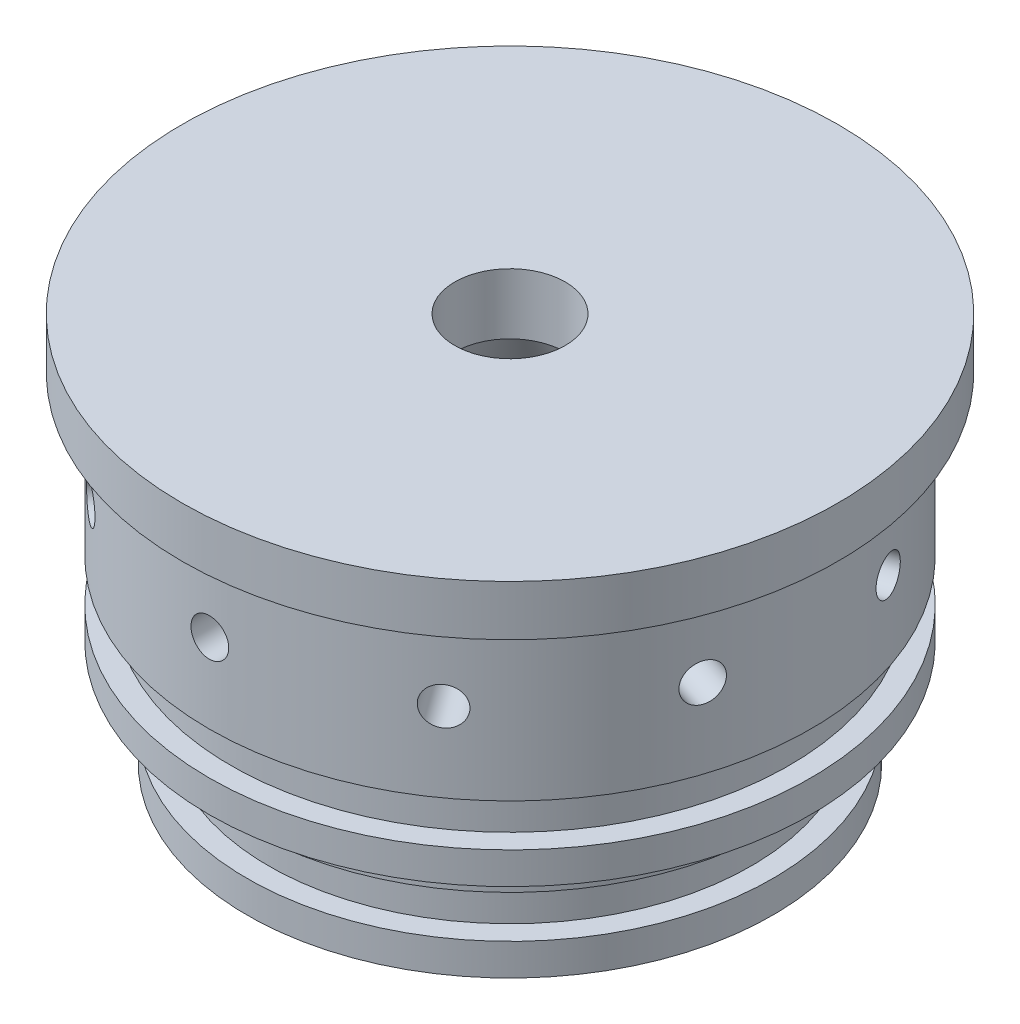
ISO-10303-21;
HEADER;
FILE_DESCRIPTION(('STEP AP214'),'2;1');
FILE_NAME('part.step','',(''),(''),'','','');
FILE_SCHEMA(('AUTOMOTIVE_DESIGN { 1 0 10303 214 1 1 1 1 }'));
ENDSEC;
DATA;
#1=APPLICATION_CONTEXT('core data for automotive mechanical design processes');
#2=APPLICATION_PROTOCOL_DEFINITION('international standard','automotive_design',2000,#1);
#3=PRODUCT_CONTEXT('',#1,'mechanical');
#4=PRODUCT('Part','Part','',(#3));
#5=PRODUCT_RELATED_PRODUCT_CATEGORY('part','',(#4));
#6=PRODUCT_DEFINITION_FORMATION('','',#4);
#7=PRODUCT_DEFINITION_CONTEXT('part definition',#1,'design');
#8=PRODUCT_DEFINITION('design','',#6,#7);
#9=PRODUCT_DEFINITION_SHAPE('','',#8);
#10=(LENGTH_UNIT() NAMED_UNIT(*) SI_UNIT(.MILLI.,.METRE.));
#11=(NAMED_UNIT(*) PLANE_ANGLE_UNIT() SI_UNIT($,.RADIAN.));
#12=(NAMED_UNIT(*) SI_UNIT($,.STERADIAN.) SOLID_ANGLE_UNIT());
#13=UNCERTAINTY_MEASURE_WITH_UNIT(LENGTH_MEASURE(1.E-05),#10,'distance_accuracy_value','');
#14=(GEOMETRIC_REPRESENTATION_CONTEXT(3) GLOBAL_UNCERTAINTY_ASSIGNED_CONTEXT((#13)) GLOBAL_UNIT_ASSIGNED_CONTEXT((#10,
#11,#12)) REPRESENTATION_CONTEXT('',''));
#15=CARTESIAN_POINT('',(0.,0.,0.));
#16=DIRECTION('',(0.,0.,1.));
#17=DIRECTION('',(1.,0.,0.));
#18=AXIS2_PLACEMENT_3D('',#15,#16,#17);
#19=CARTESIAN_POINT('',(0.,0.,0.));
#20=DIRECTION('',(0.,-1.,0.));
#21=DIRECTION('',(0.,0.,-1.));
#22=AXIS2_PLACEMENT_3D('',#19,#20,#21);
#23=CYLINDRICAL_SURFACE('',#22,6.9453125);
#24=CARTESIAN_POINT('',(0.,41.3753491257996,0.));
#25=DIRECTION('',(0.,-1.,0.));
#26=DIRECTION('',(0.,0.,-1.));
#27=AXIS2_PLACEMENT_3D('',#24,#25,#26);
#28=CIRCLE('',#27,6.9453125);
#29=CARTESIAN_POINT('',(0.,41.3753491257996,-6.9453125));
#30=VERTEX_POINT('',#29);
#31=EDGE_CURVE('E198',#30,#30,#28,.T.);
#32=ORIENTED_EDGE('',*,*,#31,.T.);
#33=EDGE_LOOP('',(#32));
#34=FACE_BOUND('',#33,.T.);
#35=CARTESIAN_POINT('',(0.,49.01796,0.));
#36=DIRECTION('',(0.,-1.,0.));
#37=DIRECTION('',(0.,0.,-1.));
#38=AXIS2_PLACEMENT_3D('',#35,#36,#37);
#39=CIRCLE('',#38,6.9453125);
#40=CARTESIAN_POINT('',(0.,49.01796,-6.9453125));
#41=VERTEX_POINT('',#40);
#42=EDGE_CURVE('E201',#41,#41,#39,.T.);
#43=ORIENTED_EDGE('',*,*,#42,.F.);
#44=EDGE_LOOP('',(#43));
#45=FACE_BOUND('',#44,.T.);
#46=ADVANCED_FACE('F39',(#34,#45),#23,.F.);
#47=CARTESIAN_POINT('',(0.,41.3753491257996,0.));
#48=DIRECTION('',(0.,-1.,0.));
#49=DIRECTION('',(0.,0.,-1.));
#50=AXIS2_PLACEMENT_3D('',#47,#48,#49);
#51=CONICAL_SURFACE('',#50,6.9453125,0.438239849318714);
#52=CARTESIAN_POINT('',(0.,12.7,0.));
#53=DIRECTION('',(0.,-1.,0.));
#54=DIRECTION('',(0.,0.,-1.));
#55=AXIS2_PLACEMENT_3D('',#52,#53,#54);
#56=CIRCLE('',#55,20.3835);
#57=CARTESIAN_POINT('',(0.,12.7,-20.3835));
#58=VERTEX_POINT('',#57);
#59=EDGE_CURVE('E258',#58,#58,#56,.T.);
#60=ORIENTED_EDGE('',*,*,#59,.T.);
#61=EDGE_LOOP('',(#60));
#62=FACE_BOUND('',#61,.T.);
#63=ORIENTED_EDGE('',*,*,#31,.F.);
#64=EDGE_LOOP('',(#63));
#65=FACE_BOUND('',#64,.T.);
#66=ADVANCED_FACE('F188',(#62,#65),#51,.F.);
#67=CARTESIAN_POINT('',(0.,12.7,0.));
#68=DIRECTION('',(0.,1.,0.));
#69=DIRECTION('',(0.,0.,1.));
#70=AXIS2_PLACEMENT_3D('',#67,#68,#69);
#71=PLANE('',#70);
#72=ORIENTED_EDGE('',*,*,#59,.F.);
#73=EDGE_LOOP('',(#72));
#74=FACE_BOUND('',#73,.T.);
#75=CARTESIAN_POINT('',(0.,12.7,0.));
#76=DIRECTION('',(0.,-1.,0.));
#77=DIRECTION('',(0.,0.,-1.));
#78=AXIS2_PLACEMENT_3D('',#75,#76,#77);
#79=CIRCLE('',#78,26.7335);
#80=CARTESIAN_POINT('',(0.,12.7,-26.7335));
#81=VERTEX_POINT('',#80);
#82=EDGE_CURVE('E255',#81,#81,#79,.T.);
#83=ORIENTED_EDGE('',*,*,#82,.T.);
#84=EDGE_LOOP('',(#83));
#85=FACE_BOUND('',#84,.T.);
#86=ADVANCED_FACE('F193',(#74,#85),#71,.F.);
#87=CARTESIAN_POINT('',(0.,0.,0.));
#88=DIRECTION('',(0.,-1.,0.));
#89=DIRECTION('',(0.,0.,-1.));
#90=AXIS2_PLACEMENT_3D('',#87,#88,#89);
#91=CYLINDRICAL_SURFACE('',#90,26.7335);
#92=ORIENTED_EDGE('',*,*,#82,.F.);
#93=EDGE_LOOP('',(#92));
#94=FACE_BOUND('',#93,.T.);
#95=CARTESIAN_POINT('',(0.,0.,0.));
#96=DIRECTION('',(0.,-1.,0.));
#97=DIRECTION('',(0.,0.,-1.));
#98=AXIS2_PLACEMENT_3D('',#95,#96,#97);
#99=CIRCLE('',#98,26.7335);
#100=CARTESIAN_POINT('',(0.,0.,-26.7335));
#101=VERTEX_POINT('',#100);
#102=EDGE_CURVE('E252',#101,#101,#99,.T.);
#103=ORIENTED_EDGE('',*,*,#102,.T.);
#104=EDGE_LOOP('',(#103));
#105=FACE_BOUND('',#104,.T.);
#106=ADVANCED_FACE('F336',(#94,#105),#91,.F.);
#107=CARTESIAN_POINT('',(0.,0.,0.));
#108=DIRECTION('',(0.,-1.,0.));
#109=DIRECTION('',(0.,0.,-1.));
#110=AXIS2_PLACEMENT_3D('',#107,#108,#109);
#111=PLANE('',#110);
#112=CARTESIAN_POINT('',(0.,0.,0.));
#113=DIRECTION('',(0.,-1.,0.));
#114=DIRECTION('',(0.,0.,-1.));
#115=AXIS2_PLACEMENT_3D('',#112,#113,#114);
#116=CIRCLE('',#115,33.0835);
#117=CARTESIAN_POINT('',(0.,0.,-33.0835));
#118=VERTEX_POINT('',#117);
#119=EDGE_CURVE('E249',#118,#118,#116,.T.);
#120=ORIENTED_EDGE('',*,*,#119,.T.);
#121=EDGE_LOOP('',(#120));
#122=FACE_BOUND('',#121,.T.);
#123=ORIENTED_EDGE('',*,*,#102,.F.);
#124=EDGE_LOOP('',(#123));
#125=FACE_BOUND('',#124,.T.);
#126=ADVANCED_FACE('F330',(#122,#125),#111,.T.);
#127=CARTESIAN_POINT('',(0.,0.,0.));
#128=DIRECTION('',(0.,-1.,0.));
#129=DIRECTION('',(0.,0.,-1.));
#130=AXIS2_PLACEMENT_3D('',#127,#128,#129);
#131=CYLINDRICAL_SURFACE('',#130,33.0835);
#132=CARTESIAN_POINT('',(0.,4.,0.));
#133=DIRECTION('',(0.,-1.,0.));
#134=DIRECTION('',(0.,0.,-1.));
#135=AXIS2_PLACEMENT_3D('',#132,#133,#134);
#136=CIRCLE('',#135,33.0835);
#137=CARTESIAN_POINT('',(0.,4.,-33.0835));
#138=VERTEX_POINT('',#137);
#139=EDGE_CURVE('E246',#138,#138,#136,.T.);
#140=ORIENTED_EDGE('',*,*,#139,.T.);
#141=EDGE_LOOP('',(#140));
#142=FACE_BOUND('',#141,.T.);
#143=ORIENTED_EDGE('',*,*,#119,.F.);
#144=EDGE_LOOP('',(#143));
#145=FACE_BOUND('',#144,.T.);
#146=ADVANCED_FACE('F324',(#142,#145),#131,.T.);
#147=CARTESIAN_POINT('',(0.,4.,0.));
#148=DIRECTION('',(0.,1.,0.));
#149=DIRECTION('',(0.,0.,1.));
#150=AXIS2_PLACEMENT_3D('',#147,#148,#149);
#151=PLANE('',#150);
#152=CARTESIAN_POINT('',(0.,4.,0.));
#153=DIRECTION('',(0.,-1.,0.));
#154=DIRECTION('',(0.,0.,-1.));
#155=AXIS2_PLACEMENT_3D('',#152,#153,#154);
#156=CIRCLE('',#155,30.3657);
#157=CARTESIAN_POINT('',(0.,4.,-30.3657));
#158=VERTEX_POINT('',#157);
#159=EDGE_CURVE('E243',#158,#158,#156,.T.);
#160=ORIENTED_EDGE('',*,*,#159,.T.);
#161=EDGE_LOOP('',(#160));
#162=FACE_BOUND('',#161,.T.);
#163=ORIENTED_EDGE('',*,*,#139,.F.);
#164=EDGE_LOOP('',(#163));
#165=FACE_BOUND('',#164,.T.);
#166=ADVANCED_FACE('F318',(#162,#165),#151,.T.);
#167=CARTESIAN_POINT('',(0.,0.,0.));
#168=DIRECTION('',(0.,-1.,0.));
#169=DIRECTION('',(0.,0.,-1.));
#170=AXIS2_PLACEMENT_3D('',#167,#168,#169);
#171=CYLINDRICAL_SURFACE('',#170,30.3657);
#172=CARTESIAN_POINT('',(0.,9.334,0.));
#173=DIRECTION('',(0.,-1.,0.));
#174=DIRECTION('',(0.,0.,-1.));
#175=AXIS2_PLACEMENT_3D('',#172,#173,#174);
#176=CIRCLE('',#175,30.3657);
#177=CARTESIAN_POINT('',(0.,9.334,-30.3657));
#178=VERTEX_POINT('',#177);
#179=EDGE_CURVE('E240',#178,#178,#176,.T.);
#180=ORIENTED_EDGE('',*,*,#179,.T.);
#181=EDGE_LOOP('',(#180));
#182=FACE_BOUND('',#181,.T.);
#183=ORIENTED_EDGE('',*,*,#159,.F.);
#184=EDGE_LOOP('',(#183));
#185=FACE_BOUND('',#184,.T.);
#186=ADVANCED_FACE('F312',(#182,#185),#171,.T.);
#187=CARTESIAN_POINT('',(0.,9.334,0.));
#188=DIRECTION('',(0.,-1.,0.));
#189=DIRECTION('',(0.,0.,-1.));
#190=AXIS2_PLACEMENT_3D('',#187,#188,#189);
#191=PLANE('',#190);
#192=CARTESIAN_POINT('',(0.,9.334,0.));
#193=DIRECTION('',(0.,-1.,0.));
#194=DIRECTION('',(0.,0.,-1.));
#195=AXIS2_PLACEMENT_3D('',#192,#193,#194);
#196=CIRCLE('',#195,33.0835);
#197=CARTESIAN_POINT('',(0.,9.334,-33.0835));
#198=VERTEX_POINT('',#197);
#199=EDGE_CURVE('E237',#198,#198,#196,.T.);
#200=ORIENTED_EDGE('',*,*,#199,.T.);
#201=EDGE_LOOP('',(#200));
#202=FACE_BOUND('',#201,.T.);
#203=ORIENTED_EDGE('',*,*,#179,.F.);
#204=EDGE_LOOP('',(#203));
#205=FACE_BOUND('',#204,.T.);
#206=ADVANCED_FACE('F306',(#202,#205),#191,.T.);
#207=CARTESIAN_POINT('',(0.,0.,0.));
#208=DIRECTION('',(0.,-1.,0.));
#209=DIRECTION('',(0.,0.,-1.));
#210=AXIS2_PLACEMENT_3D('',#207,#208,#209);
#211=CYLINDRICAL_SURFACE('',#210,33.0835);
#212=CARTESIAN_POINT('',(0.,13.334,0.));
#213=DIRECTION('',(0.,-1.,0.));
#214=DIRECTION('',(0.,0.,-1.));
#215=AXIS2_PLACEMENT_3D('',#212,#213,#214);
#216=CIRCLE('',#215,33.0835);
#217=CARTESIAN_POINT('',(0.,13.334,-33.0835));
#218=VERTEX_POINT('',#217);
#219=EDGE_CURVE('E234',#218,#218,#216,.T.);
#220=ORIENTED_EDGE('',*,*,#219,.T.);
#221=EDGE_LOOP('',(#220));
#222=FACE_BOUND('',#221,.T.);
#223=ORIENTED_EDGE('',*,*,#199,.F.);
#224=EDGE_LOOP('',(#223));
#225=FACE_BOUND('',#224,.T.);
#226=ADVANCED_FACE('F300',(#222,#225),#211,.T.);
#227=CARTESIAN_POINT('',(0.,13.334,0.));
#228=DIRECTION('',(0.,-1.,0.));
#229=DIRECTION('',(0.,0.,-1.));
#230=AXIS2_PLACEMENT_3D('',#227,#228,#229);
#231=PLANE('',#230);
#232=CARTESIAN_POINT('',(0.,13.334,0.));
#233=DIRECTION('',(0.,-1.,0.));
#234=DIRECTION('',(0.,0.,-1.));
#235=AXIS2_PLACEMENT_3D('',#232,#233,#234);
#236=CIRCLE('',#235,37.846);
#237=CARTESIAN_POINT('',(0.,13.334,-37.846));
#238=VERTEX_POINT('',#237);
#239=EDGE_CURVE('E231',#238,#238,#236,.T.);
#240=ORIENTED_EDGE('',*,*,#239,.T.);
#241=EDGE_LOOP('',(#240));
#242=FACE_BOUND('',#241,.T.);
#243=ORIENTED_EDGE('',*,*,#219,.F.);
#244=EDGE_LOOP('',(#243));
#245=FACE_BOUND('',#244,.T.);
#246=ADVANCED_FACE('F294',(#242,#245),#231,.T.);
#247=CARTESIAN_POINT('',(0.,0.,0.));
#248=DIRECTION('',(0.,-1.,0.));
#249=DIRECTION('',(0.,0.,-1.));
#250=AXIS2_PLACEMENT_3D('',#247,#248,#249);
#251=CYLINDRICAL_SURFACE('',#250,37.846);
#252=CARTESIAN_POINT('',(0.,17.334,0.));
#253=DIRECTION('',(0.,-1.,0.));
#254=DIRECTION('',(0.,0.,-1.));
#255=AXIS2_PLACEMENT_3D('',#252,#253,#254);
#256=CIRCLE('',#255,37.846);
#257=CARTESIAN_POINT('',(0.,17.334,-37.846));
#258=VERTEX_POINT('',#257);
#259=EDGE_CURVE('E228',#258,#258,#256,.T.);
#260=ORIENTED_EDGE('',*,*,#259,.T.);
#261=EDGE_LOOP('',(#260));
#262=FACE_BOUND('',#261,.T.);
#263=ORIENTED_EDGE('',*,*,#239,.F.);
#264=EDGE_LOOP('',(#263));
#265=FACE_BOUND('',#264,.T.);
#266=ADVANCED_FACE('F288',(#262,#265),#251,.T.);
#267=CARTESIAN_POINT('',(0.,17.334,0.));
#268=DIRECTION('',(0.,1.,0.));
#269=DIRECTION('',(0.,0.,1.));
#270=AXIS2_PLACEMENT_3D('',#267,#268,#269);
#271=PLANE('',#270);
#272=CARTESIAN_POINT('',(0.,17.334,0.));
#273=DIRECTION('',(0.,-1.,0.));
#274=DIRECTION('',(0.,0.,-1.));
#275=AXIS2_PLACEMENT_3D('',#272,#273,#274);
#276=CIRCLE('',#275,35.1282);
#277=CARTESIAN_POINT('',(0.,17.334,-35.1282));
#278=VERTEX_POINT('',#277);
#279=EDGE_CURVE('E225',#278,#278,#276,.T.);
#280=ORIENTED_EDGE('',*,*,#279,.T.);
#281=EDGE_LOOP('',(#280));
#282=FACE_BOUND('',#281,.T.);
#283=ORIENTED_EDGE('',*,*,#259,.F.);
#284=EDGE_LOOP('',(#283));
#285=FACE_BOUND('',#284,.T.);
#286=ADVANCED_FACE('F282',(#282,#285),#271,.T.);
#287=CARTESIAN_POINT('',(0.,0.,0.));
#288=DIRECTION('',(0.,-1.,0.));
#289=DIRECTION('',(0.,0.,-1.));
#290=AXIS2_PLACEMENT_3D('',#287,#288,#289);
#291=CYLINDRICAL_SURFACE('',#290,35.1282);
#292=CARTESIAN_POINT('',(0.,22.668,0.));
#293=DIRECTION('',(0.,-1.,0.));
#294=DIRECTION('',(0.,0.,-1.));
#295=AXIS2_PLACEMENT_3D('',#292,#293,#294);
#296=CIRCLE('',#295,35.1282);
#297=CARTESIAN_POINT('',(0.,22.668,-35.1282));
#298=VERTEX_POINT('',#297);
#299=EDGE_CURVE('E222',#298,#298,#296,.T.);
#300=ORIENTED_EDGE('',*,*,#299,.T.);
#301=EDGE_LOOP('',(#300));
#302=FACE_BOUND('',#301,.T.);
#303=ORIENTED_EDGE('',*,*,#279,.F.);
#304=EDGE_LOOP('',(#303));
#305=FACE_BOUND('',#304,.T.);
#306=ADVANCED_FACE('F277',(#302,#305),#291,.T.);
#307=CARTESIAN_POINT('',(0.,22.668,0.));
#308=DIRECTION('',(0.,-1.,0.));
#309=DIRECTION('',(0.,0.,-1.));
#310=AXIS2_PLACEMENT_3D('',#307,#308,#309);
#311=PLANE('',#310);
#312=CARTESIAN_POINT('',(0.,22.668,0.));
#313=DIRECTION('',(0.,-1.,0.));
#314=DIRECTION('',(0.,0.,-1.));
#315=AXIS2_PLACEMENT_3D('',#312,#313,#314);
#316=CIRCLE('',#315,37.846);
#317=CARTESIAN_POINT('',(0.,22.668,-37.846));
#318=VERTEX_POINT('',#317);
#319=EDGE_CURVE('E219',#318,#318,#316,.T.);
#320=ORIENTED_EDGE('',*,*,#319,.T.);
#321=EDGE_LOOP('',(#320));
#322=FACE_BOUND('',#321,.T.);
#323=ORIENTED_EDGE('',*,*,#299,.F.);
#324=EDGE_LOOP('',(#323));
#325=FACE_BOUND('',#324,.T.);
#326=ADVANCED_FACE('F269',(#322,#325),#311,.T.);
#327=CARTESIAN_POINT('',(0.,0.,0.));
#328=DIRECTION('',(0.,-1.,0.));
#329=DIRECTION('',(0.,0.,-1.));
#330=AXIS2_PLACEMENT_3D('',#327,#328,#329);
#331=CYLINDRICAL_SURFACE('',#330,37.846);
#332=CARTESIAN_POINT('',(24.1228134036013,32.66798,29.1617830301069));
#333=CARTESIAN_POINT('',(24.1228092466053,32.8012381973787,29.1617872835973));
#334=CARTESIAN_POINT('',(24.1141280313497,32.9345896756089,29.1689743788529));
#335=CARTESIAN_POINT('',(24.0795871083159,33.1976103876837,29.197494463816));
#336=CARTESIAN_POINT('',(24.0537074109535,33.3272751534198,29.2188439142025));
#337=CARTESIAN_POINT('',(23.9854130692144,33.579074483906,29.2749315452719));
#338=CARTESIAN_POINT('',(23.9430071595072,33.7012129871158,29.3096626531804));
#339=CARTESIAN_POINT('',(23.8427212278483,33.9345391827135,29.3913000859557));
#340=CARTESIAN_POINT('',(23.7848447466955,34.0457293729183,29.438203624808));
#341=CARTESIAN_POINT('',(23.6549700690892,34.2542029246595,29.5426647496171));
#342=CARTESIAN_POINT('',(23.5829531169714,34.351467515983,29.6002364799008));
#343=CARTESIAN_POINT('',(23.4266683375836,34.5291682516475,29.7240785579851));
#344=CARTESIAN_POINT('',(23.3423999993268,34.6096036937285,29.7903492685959));
#345=CARTESIAN_POINT('',(23.1637190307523,34.751420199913,29.9294946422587));
#346=CARTESIAN_POINT('',(23.0692982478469,34.8127857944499,30.0023746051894));
#347=CARTESIAN_POINT('',(22.8728736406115,34.914621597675,30.1523900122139));
#348=CARTESIAN_POINT('',(22.7708698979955,34.9550920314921,30.2295254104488));
#349=CARTESIAN_POINT('',(22.5621977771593,35.0139367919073,30.3855868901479));
#350=CARTESIAN_POINT('',(22.4555357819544,35.0323404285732,30.4645104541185));
#351=CARTESIAN_POINT('',(22.2403991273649,35.0466196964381,30.6219222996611));
#352=CARTESIAN_POINT('',(22.1319244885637,35.0424955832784,30.7004105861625));
#353=CARTESIAN_POINT('',(21.9164161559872,35.0118605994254,30.8546261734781));
#354=CARTESIAN_POINT('',(21.8093806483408,34.9853812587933,30.9303572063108));
#355=CARTESIAN_POINT('',(21.5997091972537,34.9108364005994,31.0771405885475));
#356=CARTESIAN_POINT('',(21.4970732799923,34.8627707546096,31.1481929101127));
#357=CARTESIAN_POINT('',(21.2991714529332,34.7463819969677,31.2838525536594));
#358=CARTESIAN_POINT('',(21.2039108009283,34.6780445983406,31.3484552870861));
#359=CARTESIAN_POINT('',(21.0237094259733,34.5230625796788,31.4695911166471));
#360=CARTESIAN_POINT('',(20.938768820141,34.4364177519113,31.5261241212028));
#361=CARTESIAN_POINT('',(20.7816720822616,34.2471023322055,31.6299023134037));
#362=CARTESIAN_POINT('',(20.7095382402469,34.1444043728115,31.6771313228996));
#363=CARTESIAN_POINT('',(20.5804864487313,33.9259937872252,31.7611278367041));
#364=CARTESIAN_POINT('',(20.523568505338,33.8102811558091,31.7978953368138));
#365=CARTESIAN_POINT('',(20.4267501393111,33.5691083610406,31.8601777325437));
#366=CARTESIAN_POINT('',(20.3868506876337,33.4436476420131,31.8856919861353));
#367=CARTESIAN_POINT('',(20.3253577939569,33.1865480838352,31.9249258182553));
#368=CARTESIAN_POINT('',(20.3037641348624,33.0549093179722,31.9386455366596));
#369=CARTESIAN_POINT('',(20.2796041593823,32.7894306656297,31.9539916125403));
#370=CARTESIAN_POINT('',(20.2770054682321,32.6555949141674,31.9556385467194));
#371=CARTESIAN_POINT('',(20.2908342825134,32.3893102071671,31.9468593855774));
#372=CARTESIAN_POINT('',(20.3072616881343,32.2568612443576,31.9364333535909));
#373=CARTESIAN_POINT('',(20.3585888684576,31.9972181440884,31.9037378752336));
#374=CARTESIAN_POINT('',(20.3934737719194,31.8700198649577,31.8814779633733));
#375=CARTESIAN_POINT('',(20.4805870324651,31.6243609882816,31.8255861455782));
#376=CARTESIAN_POINT('',(20.5328155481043,31.5059004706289,31.7919541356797));
#377=CARTESIAN_POINT('',(20.6530430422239,31.2809039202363,31.7139819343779));
#378=CARTESIAN_POINT('',(20.7210632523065,31.1743842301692,31.6696273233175));
#379=CARTESIAN_POINT('',(20.8707083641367,30.9764576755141,31.5712091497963));
#380=CARTESIAN_POINT('',(20.9523334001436,30.8850509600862,31.5171454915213));
#381=CARTESIAN_POINT('',(21.1267984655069,30.7198157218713,31.4004635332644));
#382=CARTESIAN_POINT('',(21.2196540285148,30.6460119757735,31.3378333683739));
#383=CARTESIAN_POINT('',(21.4136671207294,30.5182472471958,31.2055818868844));
#384=CARTESIAN_POINT('',(21.5148245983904,30.4642861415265,31.1359606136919));
#385=CARTESIAN_POINT('',(21.7223397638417,30.3777815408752,30.9915412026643));
#386=CARTESIAN_POINT('',(21.828693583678,30.3452223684,30.9167468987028));
#387=CARTESIAN_POINT('',(22.0435456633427,30.302394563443,30.7639266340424));
#388=CARTESIAN_POINT('',(22.1520439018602,30.2921257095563,30.6859007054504));
#389=CARTESIAN_POINT('',(22.3678743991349,30.2941721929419,30.5289319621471));
#390=CARTESIAN_POINT('',(22.4752083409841,30.3064487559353,30.4499909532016));
#391=CARTESIAN_POINT('',(22.6858901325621,30.3531571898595,30.2933547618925));
#392=CARTESIAN_POINT('',(22.7892379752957,30.3875890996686,30.2156595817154));
#393=CARTESIAN_POINT('',(22.9891228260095,30.4776220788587,30.0638605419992));
#394=CARTESIAN_POINT('',(23.0856598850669,30.5332229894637,29.9897566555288));
#395=CARTESIAN_POINT('',(23.2693551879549,30.6640102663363,29.8474511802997));
#396=CARTESIAN_POINT('',(23.3565136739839,30.7391961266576,29.7792494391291));
#397=CARTESIAN_POINT('',(23.5193271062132,30.9071622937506,29.6508306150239));
#398=CARTESIAN_POINT('',(23.5949633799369,30.9999706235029,29.5906265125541));
#399=CARTESIAN_POINT('',(23.7326557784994,31.2005097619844,29.4803082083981));
#400=CARTESIAN_POINT('',(23.7947085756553,31.308244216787,29.4301964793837));
#401=CARTESIAN_POINT('',(23.90372020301,31.5357014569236,29.3417250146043));
#402=CARTESIAN_POINT('',(23.9506601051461,31.6554390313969,29.3033800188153));
#403=CARTESIAN_POINT('',(24.028128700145,31.90330935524,29.2398919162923));
#404=CARTESIAN_POINT('',(24.0586766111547,32.0314320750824,29.2147333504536));
#405=CARTESIAN_POINT('',(24.0946786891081,32.2449452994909,29.1850386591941));
#406=CARTESIAN_POINT('',(24.1052171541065,32.3289557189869,29.176331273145));
#407=CARTESIAN_POINT('',(24.119285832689,32.4979581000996,29.1647021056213));
#408=CARTESIAN_POINT('',(24.1228160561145,32.5829500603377,29.1617803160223));
#409=CARTESIAN_POINT('',(24.1228134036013,32.66798,29.1617830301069));
#410=B_SPLINE_CURVE_WITH_KNOTS('',3,(#332,#333,#334,#335,#336,#337,#338,#339,#340,#341,#342,
#343,#344,#345,#346,#347,#348,#349,#350,#351,#352,#353,#354,#355,#356,#357,#358,#359,#360,#361,
#362,#363,#364,#365,#366,#367,#368,#369,#370,#371,#372,#373,#374,#375,#376,#377,#378,#379,#380,
#381,#382,#383,#384,#385,#386,#387,#388,#389,#390,#391,#392,#393,#394,#395,#396,#397,#398,#399,
#400,#401,#402,#403,#404,#405,#406,#407,#408,#409),.UNSPECIFIED.,.T.,.F.,(4,2,2,2,2,2,2,2,2,2,2,
2,2,2,2,2,2,2,2,2,2,2,2,2,2,2,2,2,2,2,2,2,2,2,2,2,2,2,4),(0.,0.399464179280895,
0.799393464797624,1.19911166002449,1.59873844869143,1.99889892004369,2.39907608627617,
2.79957703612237,3.20007367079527,3.60003775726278,3.99999730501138,4.39939368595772,
4.79879244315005,5.19847335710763,5.59815880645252,5.99853322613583,6.39890780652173,
6.79930522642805,7.19969789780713,7.59940798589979,7.99911597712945,8.39850241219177,
8.79789249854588,9.19782269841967,9.59775684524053,9.99825063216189,10.3987419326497,
10.7989395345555,11.1991331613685,11.5986391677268,11.9981458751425,12.3976495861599,
12.7971429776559,13.1972770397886,13.5975090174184,13.9982403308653,14.3985007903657,
14.6533928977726,14.9082846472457),.UNSPECIFIED.);
#411=CARTESIAN_POINT('',(24.1228134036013,32.66798,29.1617830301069));
#412=VERTEX_POINT('',#411);
#413=EDGE_CURVE('E10',#412,#412,#410,.T.);
#414=ORIENTED_EDGE('',*,*,#413,.F.);
#415=EDGE_LOOP('',(#414));
#416=FACE_BOUND('',#415,.T.);
#417=CARTESIAN_POINT('',(36.656631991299,32.66798,9.41334409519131));
#418=CARTESIAN_POINT('',(36.6566311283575,32.8012381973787,9.41334997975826));
#419=CARTESIAN_POINT('',(36.653832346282,32.9345896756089,9.42426715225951));
#420=CARTESIAN_POINT('',(36.6426518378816,33.1976103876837,9.46764303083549));
#421=CARTESIAN_POINT('',(36.6342636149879,33.3272751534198,9.50012680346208));
#422=CARTESIAN_POINT('',(36.61197981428,33.579074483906,9.58564505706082));
#423=CARTESIAN_POINT('',(36.5980871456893,33.7012129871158,9.63866868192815));
#424=CARTESIAN_POINT('',(36.5649394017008,33.9345391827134,9.76366134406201));
#425=CARTESIAN_POINT('',(36.5456855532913,34.0457293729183,9.8356260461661));
#426=CARTESIAN_POINT('',(36.5020154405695,34.2542029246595,9.99647529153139));
#427=CARTESIAN_POINT('',(36.4775923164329,34.351467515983,10.0853823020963));
#428=CARTESIAN_POINT('',(36.4239478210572,34.5291682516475,10.2774345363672));
#429=CARTESIAN_POINT('',(36.3947262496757,34.6096036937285,10.3805803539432));
#430=CARTESIAN_POINT('',(36.3319579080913,34.751420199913,10.5981773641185));
#431=CARTESIAN_POINT('',(36.2984076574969,34.8127857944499,10.7126376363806));
#432=CARTESIAN_POINT('',(36.2276736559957,34.914621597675,10.9494581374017));
#433=CARTESIAN_POINT('',(36.1904899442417,34.9550920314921,11.0718182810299));
#434=CARTESIAN_POINT('',(36.113401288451,35.0139367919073,11.320729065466));
#435=CARTESIAN_POINT('',(36.0735000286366,35.0323404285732,11.4472739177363));
#436=CARTESIAN_POINT('',(35.9919751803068,35.0466196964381,11.7010769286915));
#437=CARTESIAN_POINT('',(35.9503516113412,35.0424955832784,11.8283350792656));
#438=CARTESIAN_POINT('',(35.8666473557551,35.0118605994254,12.079770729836));
#439=CARTESIAN_POINT('',(35.8245673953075,34.9853812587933,12.2039523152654));
#440=CARTESIAN_POINT('',(35.7412167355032,34.9108364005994,12.4459443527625));
#441=CARTESIAN_POINT('',(35.6999460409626,34.8627707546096,12.5637547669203));
#442=CARTESIAN_POINT('',(35.6195788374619,34.7463819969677,12.7898294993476));
#443=CARTESIAN_POINT('',(35.5804838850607,34.6780445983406,12.898087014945));
#444=CARTESIAN_POINT('',(35.5058997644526,34.5230625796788,13.102007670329));
#445=CARTESIAN_POINT('',(35.4704106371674,34.4364177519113,13.1976706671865));
#446=CARTESIAN_POINT('',(35.4043159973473,34.2471023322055,13.3739681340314));
#447=CARTESIAN_POINT('',(35.3737190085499,34.1444043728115,13.4545764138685));
#448=CARTESIAN_POINT('',(35.3186858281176,33.9259937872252,13.5983857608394));
#449=CARTESIAN_POINT('',(35.2942496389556,33.8102811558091,13.6615868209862));
#450=CARTESIAN_POINT('',(35.2525306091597,33.5691083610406,13.7688827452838));
#451=CARTESIAN_POINT('',(35.2352481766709,33.4436476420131,13.8129765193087));
#452=CARTESIAN_POINT('',(35.2085604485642,33.1865480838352,13.8808619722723));
#453=CARTESIAN_POINT('',(35.1991550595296,33.0549093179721,13.9046538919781));
#454=CARTESIAN_POINT('',(35.1886294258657,32.7894306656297,13.9312700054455));
#455=CARTESIAN_POINT('',(35.1874950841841,32.6555949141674,13.9341298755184));
#456=CARTESIAN_POINT('',(35.1935225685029,32.3893102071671,13.918899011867));
#457=CARTESIAN_POINT('',(35.2006843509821,32.2568612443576,13.9008083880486));
#458=CARTESIAN_POINT('',(35.222990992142,31.9972181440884,13.8441878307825));
#459=CARTESIAN_POINT('',(35.2381294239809,31.8700198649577,13.8056743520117));
#460=CARTESIAN_POINT('',(35.275753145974,31.6243609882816,13.7092530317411));
#461=CARTESIAN_POINT('',(35.2982385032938,31.5059004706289,13.6513450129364));
#462=CARTESIAN_POINT('',(35.3496736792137,31.2809039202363,13.5175962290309));
#463=CARTESIAN_POINT('',(35.3786321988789,31.1743842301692,13.4417313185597));
#464=CARTESIAN_POINT('',(35.4418488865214,30.9764576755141,13.2741501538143));
#465=CARTESIAN_POINT('',(35.4761071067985,30.8850509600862,13.182433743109));
#466=CARTESIAN_POINT('',(35.5486683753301,30.7198157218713,12.9854880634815));
#467=CARTESIAN_POINT('',(35.5869770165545,30.6460119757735,12.8802400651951));
#468=CARTESIAN_POINT('',(35.6662014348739,30.5182472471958,12.6592083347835));
#469=CARTESIAN_POINT('',(35.7071171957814,30.4642861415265,12.5434246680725));
#470=CARTESIAN_POINT('',(35.7901128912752,30.3777815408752,12.3046125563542));
#471=CARTESIAN_POINT('',(35.8321919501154,30.3452223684,12.1815894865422));
#472=CARTESIAN_POINT('',(35.9161854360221,30.302394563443,11.9316684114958));
#473=CARTESIAN_POINT('',(35.9580998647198,30.2921257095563,11.8047704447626));
#474=CARTESIAN_POINT('',(36.0404464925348,30.2941721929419,11.5509180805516));
#475=CARTESIAN_POINT('',(36.0808811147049,30.3064487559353,11.4239641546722));
#476=CARTESIAN_POINT('',(36.1592578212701,30.3531571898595,11.1734071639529));
#477=CARTESIAN_POINT('',(36.1971999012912,30.3875890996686,11.0498041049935));
#478=CARTESIAN_POINT('',(36.2696849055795,30.4776220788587,10.8095067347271));
#479=CARTESIAN_POINT('',(36.304227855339,30.5332229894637,10.6928123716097));
#480=CARTESIAN_POINT('',(36.3691954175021,30.6640102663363,10.4697114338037));
#481=CARTESIAN_POINT('',(36.3996201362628,30.7391961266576,10.3633045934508));
#482=CARTESIAN_POINT('',(36.4558562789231,30.9071622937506,10.1637122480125));
#483=CARTESIAN_POINT('',(36.4816602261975,30.9999706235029,10.0705482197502));
#484=CARTESIAN_POINT('',(36.52821224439,31.2005097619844,9.90036527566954));
#485=CARTESIAN_POINT('',(36.5489590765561,31.308244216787,9.82335031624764));
#486=CARTESIAN_POINT('',(36.5851491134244,31.5357014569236,9.68769997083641));
#487=CARTESIAN_POINT('',(36.6005856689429,31.6554390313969,9.62908763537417));
#488=CARTESIAN_POINT('',(36.6259417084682,31.90330935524,9.53218978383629));
#489=CARTESIAN_POINT('',(36.635867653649,32.0314320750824,9.4938804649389));
#490=CARTESIAN_POINT('',(36.6475398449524,32.2449452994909,9.44869546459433));
#491=CARTESIAN_POINT('',(36.650947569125,32.3289557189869,9.43545668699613));
#492=CARTESIAN_POINT('',(36.6554939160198,32.4979581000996,9.41777913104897));
#493=CARTESIAN_POINT('',(36.6566325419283,32.5829500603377,9.41334034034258));
#494=CARTESIAN_POINT('',(36.656631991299,32.66798,9.41334409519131));
#495=B_SPLINE_CURVE_WITH_KNOTS('',3,(#417,#418,#419,#420,#421,#422,#423,#424,#425,#426,#427,
#428,#429,#430,#431,#432,#433,#434,#435,#436,#437,#438,#439,#440,#441,#442,#443,#444,#445,#446,
#447,#448,#449,#450,#451,#452,#453,#454,#455,#456,#457,#458,#459,#460,#461,#462,#463,#464,#465,
#466,#467,#468,#469,#470,#471,#472,#473,#474,#475,#476,#477,#478,#479,#480,#481,#482,#483,#484,
#485,#486,#487,#488,#489,#490,#491,#492,#493,#494),.UNSPECIFIED.,.T.,.F.,(4,2,2,2,2,2,2,2,2,2,2,
2,2,2,2,2,2,2,2,2,2,2,2,2,2,2,2,2,2,2,2,2,2,2,2,2,2,2,4),(0.,0.399464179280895,
0.799393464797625,1.19911166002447,1.59873844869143,1.99889892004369,2.39907608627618,
2.79957703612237,3.20007367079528,3.60003775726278,3.99999730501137,4.39939368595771,
4.79879244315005,5.19847335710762,5.59815880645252,5.99853322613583,6.39890780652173,
6.79930522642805,7.19969789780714,7.59940798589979,7.99911597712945,8.39850241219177,
8.79789249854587,9.19782269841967,9.59775684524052,9.99825063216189,10.3987419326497,
10.7989395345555,11.1991331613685,11.5986391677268,11.9981458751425,12.3976495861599,
12.7971429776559,13.1972770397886,13.5975090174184,13.9982403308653,14.3985007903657,
14.6533928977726,14.9082846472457),.UNSPECIFIED.);
#496=CARTESIAN_POINT('',(36.656631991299,32.66798,9.41334409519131));
#497=VERTEX_POINT('',#496);
#498=EDGE_CURVE('E50',#497,#497,#495,.T.);
#499=ORIENTED_EDGE('',*,*,#498,.F.);
#500=EDGE_LOOP('',(#499));
#501=FACE_BOUND('',#500,.T.);
#502=CARTESIAN_POINT('',(35.1888630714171,32.66798,-13.9306723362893));
#503=CARTESIAN_POINT('',(35.1888658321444,32.8012381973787,-13.9306670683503));
#504=CARTESIAN_POINT('',(35.1930185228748,32.9345896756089,-13.9201898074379));
#505=CARTESIAN_POINT('',(35.2094690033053,33.1976103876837,-13.8785262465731));
#506=CARTESIAN_POINT('',(35.2217762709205,33.3272751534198,-13.8473158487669));
#507=CARTESIAN_POINT('',(35.2540146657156,33.579074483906,-13.7650320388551));
#508=CARTESIAN_POINT('',(35.2739417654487,33.7012129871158,-13.7139691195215));
#509=CARTESIAN_POINT('',(35.3205935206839,33.9345391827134,-13.5933641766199));
#510=CARTESIAN_POINT('',(35.3473166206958,34.0457293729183,-13.5238263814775));
#511=CARTESIAN_POINT('',(35.4065315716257,34.2542029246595,-13.3680279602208));
#512=CARTESIAN_POINT('',(35.4390310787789,34.351467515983,-13.2817451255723));
#513=CARTESIAN_POINT('',(35.5085172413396,34.5291682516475,-13.094840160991));
#514=CARTESIAN_POINT('',(35.5455040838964,34.6096036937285,-12.9942174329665));
#515=CARTESIAN_POINT('',(35.6226237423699,34.751420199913,-12.7812834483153));
#516=CARTESIAN_POINT('',(35.6627590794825,34.8127857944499,-12.6689628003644));
#517=CARTESIAN_POINT('',(35.7447336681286,34.914621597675,-12.4357945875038));
#518=CARTESIAN_POINT('',(35.7865729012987,34.9550920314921,-12.31494711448));
#519=CARTESIAN_POINT('',(35.8705129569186,35.0139367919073,-12.0682624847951));
#520=CARTESIAN_POINT('',(35.9126133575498,35.0323404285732,-11.942432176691));
#521=CARTESIAN_POINT('',(35.995840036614,35.0466196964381,-11.6891821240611));
#522=CARTESIAN_POINT('',(36.0369663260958,35.0424955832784,-11.5617623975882));
#523=CARTESIAN_POINT('',(36.117038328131,35.0118605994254,-11.3091465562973));
#524=CARTESIAN_POINT('',(36.155987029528,34.9853812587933,-11.1839475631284));
#525=CARTESIAN_POINT('',(36.2307942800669,34.9108364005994,-10.939179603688));
#526=CARTESIAN_POINT('',(36.2666528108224,34.8627707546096,-10.8196106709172));
#527=CARTESIAN_POINT('',(36.3345177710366,34.7463819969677,-10.5894737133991));
#528=CARTESIAN_POINT('',(36.3665214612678,34.6780445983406,-10.4789121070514));
#529=CARTESIAN_POINT('',(36.4260431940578,34.5230625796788,-10.270097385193));
#530=CARTESIAN_POINT('',(36.4535611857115,34.4364177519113,-10.1718444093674));
#531=CARTESIAN_POINT('',(36.5037145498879,34.2471023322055,-9.99036730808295));
#532=CARTESIAN_POINT('',(36.526341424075,34.1444043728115,-9.90716938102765));
#533=CARTESIAN_POINT('',(36.5663476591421,33.9259937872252,-9.75847748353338));
#534=CARTESIAN_POINT('',(36.5837270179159,33.8102811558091,-9.69298352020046));
#535=CARTESIAN_POINT('',(36.6130425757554,33.5691083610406,-9.58165746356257));
#536=CARTESIAN_POINT('',(36.6249784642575,33.4436476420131,-9.53582649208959));
#537=CARTESIAN_POINT('',(36.6432897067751,33.1865480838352,-9.46521935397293));
#538=CARTESIAN_POINT('',(36.6496651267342,33.0549093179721,-9.44044293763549));
#539=CARTESIAN_POINT('',(36.6567942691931,32.7894306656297,-9.41272323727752));
#540=CARTESIAN_POINT('',(36.6575575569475,32.6555949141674,-9.40974280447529));
#541=CARTESIAN_POINT('',(36.6534814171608,32.3893102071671,-9.42560769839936));
#542=CARTESIAN_POINT('',(36.6486420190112,32.2568612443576,-9.44445291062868));
#543=CARTESIAN_POINT('',(36.6334077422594,31.9972181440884,-9.50337141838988));
#544=CARTESIAN_POINT('',(36.6230173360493,31.8700198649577,-9.54342762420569));
#545=CARTESIAN_POINT('',(36.5967805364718,31.6243609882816,-9.64354877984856));
#546=CARTESIAN_POINT('',(36.5809340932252,31.5059004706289,-9.70361391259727));
#547=CARTESIAN_POINT('',(36.5439304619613,31.2809039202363,-9.84205178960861));
#548=CARTESIAN_POINT('',(36.522766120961,31.1743842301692,-9.92044918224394));
#549=CARTESIAN_POINT('',(36.4754077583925,30.9764576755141,-10.0931830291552));
#550=CARTESIAN_POINT('',(36.4492136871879,30.8850509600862,-10.1875196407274));
#551=CARTESIAN_POINT('',(36.3921552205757,30.7198157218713,-10.3895024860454));
#552=CARTESIAN_POINT('',(36.3612843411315,30.6460119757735,-10.49716715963));
#553=CARTESIAN_POINT('',(36.2954590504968,30.5182472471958,-10.7225525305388));
#554=CARTESIAN_POINT('',(36.2605046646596,30.4642861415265,-10.8402731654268));
#555=CARTESIAN_POINT('',(36.1872793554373,30.3777815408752,-11.0822598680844));
#556=CARTESIAN_POINT('',(36.1490108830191,30.3452223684,-11.2065210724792));
#557=CARTESIAN_POINT('',(36.0700631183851,30.3023945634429,-11.4580816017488));
#558=CARTESIAN_POINT('',(36.0293838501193,30.2921257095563,-11.5853808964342));
#559=CARTESIAN_POINT('',(35.9467929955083,30.2941721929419,-11.8391539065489));
#560=CARTESIAN_POINT('',(35.9048836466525,30.3064487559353,-11.9656286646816));
#561=CARTESIAN_POINT('',(35.8210180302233,30.3531571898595,-12.2144022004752));
#562=CARTESIAN_POINT('',(35.7790617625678,30.3875890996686,-12.3367009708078));
#563=CARTESIAN_POINT('',(35.6964601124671,30.4776220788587,-12.5737112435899));
#564=CARTESIAN_POINT('',(35.6558147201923,30.5332229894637,-12.688422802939));
#565=CARTESIAN_POINT('',(35.5772391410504,30.6640102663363,-12.9071022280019));
#566=CARTESIAN_POINT('',(35.5393088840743,30.7391961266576,-13.0110703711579));
#567=CARTESIAN_POINT('',(35.4674874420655,30.9071622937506,-13.2055987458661));
#568=CARTESIAN_POINT('',(35.4336028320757,30.9999706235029,-13.2961372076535));
#569=CARTESIAN_POINT('',(35.3712331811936,31.2005097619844,-13.4611806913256));
#570=CARTESIAN_POINT('',(35.3427494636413,31.308244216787,-13.535681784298));
#571=CARTESIAN_POINT('',(35.2922945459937,31.5357014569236,-13.6666971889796));
#572=CARTESIAN_POINT('',(35.2703315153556,31.6554390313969,-13.7231889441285));
#573=CARTESIAN_POINT('',(35.2338898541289,31.90330935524,-13.8164848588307));
#574=CARTESIAN_POINT('',(35.2194024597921,32.0314320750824,-13.8533120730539));
#575=CARTESIAN_POINT('',(35.2022863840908,32.2449452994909,-13.8967282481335));
#576=CARTESIAN_POINT('',(35.197261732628,32.3289557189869,-13.9094416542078));
#577=CARTESIAN_POINT('',(35.1905491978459,32.4979581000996,-13.9264153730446));
#578=CARTESIAN_POINT('',(35.1888613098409,32.5829500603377,-13.9306756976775));
#579=CARTESIAN_POINT('',(35.1888630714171,32.66798,-13.9306723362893));
#580=B_SPLINE_CURVE_WITH_KNOTS('',3,(#502,#503,#504,#505,#506,#507,#508,#509,#510,#511,#512,
#513,#514,#515,#516,#517,#518,#519,#520,#521,#522,#523,#524,#525,#526,#527,#528,#529,#530,#531,
#532,#533,#534,#535,#536,#537,#538,#539,#540,#541,#542,#543,#544,#545,#546,#547,#548,#549,#550,
#551,#552,#553,#554,#555,#556,#557,#558,#559,#560,#561,#562,#563,#564,#565,#566,#567,#568,#569,
#570,#571,#572,#573,#574,#575,#576,#577,#578,#579),.UNSPECIFIED.,.T.,.F.,(4,2,2,2,2,2,2,2,2,2,2,
2,2,2,2,2,2,2,2,2,2,2,2,2,2,2,2,2,2,2,2,2,2,2,2,2,2,2,4),(0.,0.399464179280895,
0.799393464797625,1.19911166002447,1.59873844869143,1.99889892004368,2.39907608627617,
2.79957703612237,3.20007367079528,3.60003775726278,3.99999730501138,4.39939368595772,
4.79879244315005,5.19847335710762,5.59815880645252,5.99853322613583,6.39890780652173,
6.79930522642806,7.19969789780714,7.59940798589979,7.99911597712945,8.39850241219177,
8.79789249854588,9.19782269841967,9.59775684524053,9.99825063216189,10.3987419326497,
10.7989395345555,11.1991331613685,11.5986391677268,11.9981458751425,12.3976495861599,
12.7971429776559,13.1972770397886,13.5975090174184,13.9982403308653,14.3985007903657,
14.6533928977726,14.9082846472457),.UNSPECIFIED.);
#581=CARTESIAN_POINT('',(35.1888630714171,32.66798,-13.9306723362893));
#582=VERTEX_POINT('',#581);
#583=EDGE_CURVE('E54',#582,#582,#580,.T.);
#584=ORIENTED_EDGE('',*,*,#583,.F.);
#585=EDGE_LOOP('',(#584));
#586=FACE_BOUND('',#585,.T.);
#587=CARTESIAN_POINT('',(20.2801444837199,32.66798,-31.9536454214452));
#588=CARTESIAN_POINT('',(20.280149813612,32.8012381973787,-31.9536427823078));
#589=CARTESIAN_POINT('',(20.289667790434,32.9345896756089,-31.9476073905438));
#590=CARTESIAN_POINT('',(20.3274657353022,33.1976103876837,-31.9235702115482));
#591=CARTESIAN_POINT('',(20.3557675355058,33.3272751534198,-31.9055544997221));
#592=CARTESIAN_POINT('',(20.4302141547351,33.579074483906,-31.8579347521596));
#593=CARTESIAN_POINT('',(20.476349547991,33.7012129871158,-31.8283368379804));
#594=CARTESIAN_POINT('',(20.5849814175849,33.9345391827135,-31.7581866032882));
#595=CARTESIAN_POINT('',(20.6474741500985,34.0457293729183,-31.7176367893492));
#596=CARTESIAN_POINT('',(20.7869560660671,34.2542029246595,-31.6263988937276));
#597=CARTESIAN_POINT('',(20.8639644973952,34.351467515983,-31.5756973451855));
#598=CARTESIAN_POINT('',(21.0300399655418,34.5291682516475,-31.4653309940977));
#599=CARTESIAN_POINT('',(21.1191075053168,34.6096036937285,-31.4056658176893));
#600=CARTESIAN_POINT('',(21.3066580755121,34.751420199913,-31.278728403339));
#601=CARTESIAN_POINT('',(21.4051486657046,34.8127857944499,-31.2114500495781));
#602=CARTESIAN_POINT('',(21.6085203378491,34.914621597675,-31.0709964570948));
#603=CARTESIAN_POINT('',(21.7134013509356,34.9550920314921,-30.9978212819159));
#604=CARTESIAN_POINT('',(21.9263078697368,35.0139367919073,-30.8475879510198));
#605=CARTESIAN_POINT('',(22.0343290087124,35.0323404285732,-30.7705350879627));
#606=CARTESIAN_POINT('',(22.2505174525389,35.0466196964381,-30.61457090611));
#607=CARTESIAN_POINT('',(22.3586847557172,35.0424955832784,-30.5356596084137));
#608=CARTESIAN_POINT('',(22.5719482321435,35.0118605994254,-30.3783542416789));
#609=CARTESIAN_POINT('',(22.6770485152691,34.9853812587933,-30.2999596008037));
#610=CARTESIAN_POINT('',(22.8814398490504,34.9108364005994,-30.1459087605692));
#611=CARTESIAN_POINT('',(22.9807308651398,34.8627707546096,-30.0702525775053));
#612=CARTESIAN_POINT('',(23.1709058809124,34.7463819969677,-29.9239578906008));
#613=CARTESIAN_POINT('',(23.261783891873,34.6780445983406,-29.8533229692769));
#614=CARTESIAN_POINT('',(23.4326761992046,34.5230625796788,-29.7193743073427));
#615=CARTESIAN_POINT('',(23.5126903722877,34.4364177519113,-29.6560606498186));
#616=CARTESIAN_POINT('',(23.6599348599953,34.2471023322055,-29.5387219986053));
#617=CARTESIAN_POINT('',(23.7271429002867,34.1444043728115,-29.4847132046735));
#618=CARTESIAN_POINT('',(23.8469075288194,33.9259937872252,-29.3879340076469));
#619=CARTESIAN_POINT('',(23.89946411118,33.8102811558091,-29.3451636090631));
#620=CARTESIAN_POINT('',(23.9886167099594,33.5691083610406,-29.2723301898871));
#621=CARTESIAN_POINT('',(24.0252118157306,33.4436476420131,-29.2422678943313));
#622=CARTESIAN_POINT('',(24.081527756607,33.1865480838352,-29.1959085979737));
#623=CARTESIAN_POINT('',(24.1012487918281,33.0549093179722,-29.1796114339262));
#624=CARTESIAN_POINT('',(24.123309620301,32.7894306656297,-29.1613761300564));
#625=CARTESIAN_POINT('',(24.1256789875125,32.6555949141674,-29.1594135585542));
#626=CARTESIAN_POINT('',(24.1130561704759,32.3893102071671,-29.1698526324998));
#627=CARTESIAN_POINT('',(24.0980640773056,32.2568612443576,-29.1822542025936));
#628=CARTESIAN_POINT('',(24.0511078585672,31.9972181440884,-29.2209657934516));
#629=CARTESIAN_POINT('',(24.0191573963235,31.8700198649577,-29.2472646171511));
#630=CARTESIAN_POINT('',(23.9390816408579,31.6243609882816,-29.3128427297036));
#631=CARTESIAN_POINT('',(23.8909561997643,31.5059004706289,-29.3521221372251));
#632=CARTESIAN_POINT('',(23.7796478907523,31.2809039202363,-29.4423705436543));
#633=CARTESIAN_POINT('',(23.7164447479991,31.1743842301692,-29.4933552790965));
#634=CARTESIAN_POINT('',(23.5766006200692,30.9764576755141,-29.6052633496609));
#635=CARTESIAN_POINT('',(23.4999595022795,30.8850509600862,-29.6661867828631));
#636=CARTESIAN_POINT('',(23.3350756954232,30.7198157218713,-29.7960562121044));
#637=CARTESIAN_POINT('',(23.2468169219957,30.6460119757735,-29.8650133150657));
#638=CARTESIAN_POINT('',(23.0610849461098,30.5182472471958,-30.0086627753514));
#639=CARTESIAN_POINT('',(22.963611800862,30.4642861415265,-30.0833550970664));
#640=CARTESIAN_POINT('',(22.7621350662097,30.3777815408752,-30.2360856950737));
#641=CARTESIAN_POINT('',(22.6581363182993,30.3452223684,-30.3141214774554));
#642=CARTESIAN_POINT('',(22.4464026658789,30.302394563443,-30.4712338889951));
#643=CARTESIAN_POINT('',(22.3386677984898,30.2921257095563,-30.5503105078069));
#644=CARTESIAN_POINT('',(22.1226863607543,30.2941721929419,-30.7070714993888));
#645=CARTESIAN_POINT('',(22.0144409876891,30.3064487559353,-30.7847580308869));
#646=CARTESIAN_POINT('',(21.800366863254,30.3531571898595,-30.9367250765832));
#647=CARTESIAN_POINT('',(21.6945381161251,30.3875890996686,-31.0110055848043));
#648=CARTESIAN_POINT('',(21.4884008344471,30.4776220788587,-31.1541988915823));
#649=CARTESIAN_POINT('',(21.3880922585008,30.5332229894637,-31.2231117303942));
#650=CARTESIAN_POINT('',(21.1959867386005,30.6640102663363,-31.3538415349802));
#651=CARTESIAN_POINT('',(21.1041895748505,30.7391961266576,-31.4156586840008));
#652=CARTESIAN_POINT('',(20.931743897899,30.9071622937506,-31.5308198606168));
#653=CARTESIAN_POINT('',(20.8511134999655,30.9999706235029,-31.5841501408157));
#654=CARTESIAN_POINT('',(20.7036452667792,31.2005097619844,-31.6810131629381));
#655=CARTESIAN_POINT('',(20.6368108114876,31.308244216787,-31.7245435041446));
#656=CARTESIAN_POINT('',(20.5189830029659,31.5357014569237,-31.8008805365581));
#657=CARTESIAN_POINT('',(20.4680095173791,31.6554390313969,-31.8336737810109));
#658=CARTESIAN_POINT('',(20.3836896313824,31.90330935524,-31.8877318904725));
#659=CARTESIAN_POINT('',(20.3503225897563,32.0314320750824,-31.9090102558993));
#660=CARTESIAN_POINT('',(20.3109560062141,32.2449452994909,-31.9340741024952));
#661=CARTESIAN_POINT('',(20.2994182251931,32.3289557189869,-31.9414060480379));
#662=CARTESIAN_POINT('',(20.2840107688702,32.4979581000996,-31.9511925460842));
#663=CARTESIAN_POINT('',(20.2801410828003,32.5829500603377,-31.9536471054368));
#664=CARTESIAN_POINT('',(20.2801444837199,32.66798,-31.9536454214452));
#665=B_SPLINE_CURVE_WITH_KNOTS('',3,(#587,#588,#589,#590,#591,#592,#593,#594,#595,#596,#597,
#598,#599,#600,#601,#602,#603,#604,#605,#606,#607,#608,#609,#610,#611,#612,#613,#614,#615,#616,
#617,#618,#619,#620,#621,#622,#623,#624,#625,#626,#627,#628,#629,#630,#631,#632,#633,#634,#635,
#636,#637,#638,#639,#640,#641,#642,#643,#644,#645,#646,#647,#648,#649,#650,#651,#652,#653,#654,
#655,#656,#657,#658,#659,#660,#661,#662,#663,#664),.UNSPECIFIED.,.T.,.F.,(4,2,2,2,2,2,2,2,2,2,2,
2,2,2,2,2,2,2,2,2,2,2,2,2,2,2,2,2,2,2,2,2,2,2,2,2,2,2,4),(0.,0.399464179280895,
0.799393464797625,1.19911166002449,1.59873844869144,1.9988989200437,2.39907608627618,
2.79957703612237,3.20007367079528,3.60003775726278,3.99999730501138,4.39939368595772,
4.79879244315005,5.19847335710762,5.59815880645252,5.99853322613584,6.39890780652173,
6.79930522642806,7.19969789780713,7.59940798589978,7.99911597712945,8.39850241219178,
8.79789249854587,9.19782269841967,9.59775684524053,9.99825063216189,10.3987419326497,
10.7989395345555,11.1991331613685,11.5986391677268,11.9981458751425,12.3976495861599,
12.7971429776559,13.1972770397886,13.5975090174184,13.9982403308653,14.3985007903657,
14.6533928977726,14.9082846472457),.UNSPECIFIED.);
#666=CARTESIAN_POINT('',(20.2801444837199,32.66798,-31.9536454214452));
#667=VERTEX_POINT('',#666);
#668=EDGE_CURVE('E58',#667,#667,#665,.T.);
#669=ORIENTED_EDGE('',*,*,#668,.F.);
#670=EDGE_LOOP('',(#669));
#671=FACE_BOUND('',#670,.T.);
#672=CARTESIAN_POINT('',(0.,35.04288,-37.846));
#673=CARTESIAN_POINT('',(0.133258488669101,35.0428741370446,-37.8459990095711));
#674=CARTESIAN_POINT('',(0.266610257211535,35.0316263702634,-37.8452886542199));
#675=CARTESIAN_POINT('',(0.529631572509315,34.9869182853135,-37.8425231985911));
#676=CARTESIAN_POINT('',(0.659296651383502,34.9534321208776,-37.8404665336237));
#677=CARTESIAN_POINT('',(0.911096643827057,34.8652128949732,-37.8352411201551));
#678=CARTESIAN_POINT('',(1.03323549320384,34.8104910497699,-37.8320729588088));
#679=CARTESIAN_POINT('',(1.26656226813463,34.6813720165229,-37.8249808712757));
#680=CARTESIAN_POINT('',(1.377752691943,34.6069793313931,-37.8210571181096));
#681=CARTESIAN_POINT('',(1.58622597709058,34.4405073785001,-37.8128882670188));
#682=CARTESIAN_POINT('',(1.68349014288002,34.3484047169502,-37.8086427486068));
#683=CARTESIAN_POINT('',(1.86119005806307,34.149175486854,-37.8003124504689));
#684=CARTESIAN_POINT('',(1.94162510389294,34.0420482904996,-37.796227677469));
#685=CARTESIAN_POINT('',(2.08344119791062,33.8157049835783,-37.7886762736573));
#686=CARTESIAN_POINT('',(2.14480670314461,33.6964791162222,-37.7852101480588));
#687=CARTESIAN_POINT('',(2.2466423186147,33.4493912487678,-37.7792923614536));
#688=CARTESIAN_POINT('',(2.2871126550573,33.3215293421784,-37.7768406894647));
#689=CARTESIAN_POINT('',(2.34595720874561,33.0609791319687,-37.7732322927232));
#690=CARTESIAN_POINT('',(2.36436072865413,32.9282974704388,-37.7720738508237));
#691=CARTESIAN_POINT('',(2.37863969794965,32.6617235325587,-37.7711774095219));
#692=CARTESIAN_POINT('',(2.37451540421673,32.5278312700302,-37.7714393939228));
#693=CARTESIAN_POINT('',(2.34388013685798,32.2628365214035,-37.7733526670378));
#694=CARTESIAN_POINT('',(2.31740087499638,32.1317303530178,-37.7750019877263));
#695=CARTESIAN_POINT('',(2.24285650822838,31.8758273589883,-37.7795009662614));
#696=CARTESIAN_POINT('',(2.19479127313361,31.7510305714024,-37.7823506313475));
#697=CARTESIAN_POINT('',(2.07840336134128,31.511186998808,-37.7889314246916));
#698=CARTESIAN_POINT('',(2.01006630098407,31.3961472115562,-37.792663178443));
#699=CARTESIAN_POINT('',(1.85508500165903,31.1791597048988,-37.800586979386));
#700=CARTESIAN_POINT('',(1.76844055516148,31.0772121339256,-37.8047790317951));
#701=CARTESIAN_POINT('',(1.57912540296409,30.8891184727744,-37.8131597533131));
#702=CARTESIAN_POINT('',(1.47642725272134,30.8030000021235,-37.817348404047));
#703=CARTESIAN_POINT('',(1.25801612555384,30.6492221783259,-37.8252433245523));
#704=CARTESIAN_POINT('',(1.14230314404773,30.581562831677,-37.828949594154));
#705=CARTESIAN_POINT('',(0.90113026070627,30.466626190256,-37.8354624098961));
#706=CARTESIAN_POINT('',(0.775669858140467,30.4193499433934,-37.8382689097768));
#707=CARTESIAN_POINT('',(0.518570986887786,30.3465399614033,-37.8426653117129));
#708=CARTESIAN_POINT('',(0.386932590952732,30.3210059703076,-37.8442552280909));
#709=CARTESIAN_POINT('',(0.121454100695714,30.2924395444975,-37.8460374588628));
#710=CARTESIAN_POINT('',(-0.0123818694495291,30.2893689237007,-37.8462321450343));
#711=CARTESIAN_POINT('',(-0.278667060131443,30.3057166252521,-37.8452082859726));
#712=CARTESIAN_POINT('',(-0.411116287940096,30.3251348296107,-37.8439897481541));
#713=CARTESIAN_POINT('',(-0.670760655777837,30.385877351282,-37.8402781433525));
#714=CARTESIAN_POINT('',(-0.797959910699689,30.4271841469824,-37.8377860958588));
#715=CARTESIAN_POINT('',(-1.04362062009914,30.5305135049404,-37.8318078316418));
#716=CARTESIAN_POINT('',(-1.16208199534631,30.5925362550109,-37.8283216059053));
#717=CARTESIAN_POINT('',(-1.38707911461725,30.7356341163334,-37.8207407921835));
#718=CARTESIAN_POINT('',(-1.49359861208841,30.8167347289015,-37.8166453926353));
#719=CARTESIAN_POINT('',(-1.69152472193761,30.9956490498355,-37.8083098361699));
#720=CARTESIAN_POINT('',(-1.78293118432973,31.0934629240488,-37.8040696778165));
#721=CARTESIAN_POINT('',(-1.94816589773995,31.303191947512,-37.7959156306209));
#722=CARTESIAN_POINT('',(-2.02196937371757,31.4151266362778,-37.7920022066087));
#723=CARTESIAN_POINT('',(-2.14973362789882,31.6498216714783,-37.7849503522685));
#724=CARTESIAN_POINT('',(-2.20369452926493,31.7725819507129,-37.7818119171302));
#725=CARTESIAN_POINT('',(-2.29019898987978,32.0253529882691,-37.7766673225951));
#726=CARTESIAN_POINT('',(-2.32275813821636,32.1553583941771,-37.7746603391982));
#727=CARTESIAN_POINT('',(-2.36558576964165,32.4190036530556,-37.7720026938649));
#728=CARTESIAN_POINT('',(-2.37585447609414,32.5526434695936,-37.7713520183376));
#729=CARTESIAN_POINT('',(-2.37380757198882,32.8195176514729,-37.7714806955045));
#730=CARTESIAN_POINT('',(-2.361530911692,32.9527523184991,-37.7722575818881));
#731=CARTESIAN_POINT('',(-2.31482252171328,33.2152645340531,-37.7751486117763));
#732=CARTESIAN_POINT('',(-2.28039075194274,33.3445420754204,-37.7772627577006));
#733=CARTESIAN_POINT('',(-2.19035830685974,33.5954761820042,-37.7825894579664));
#734=CARTESIAN_POINT('',(-2.13475779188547,33.7171328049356,-37.7858020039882));
#735=CARTESIAN_POINT('',(-2.00397151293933,33.9493893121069,-37.7929634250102));
#736=CARTESIAN_POINT('',(-1.92878625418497,34.0599894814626,-37.7969122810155));
#737=CARTESIAN_POINT('',(-1.76082073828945,34.2671910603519,-37.8051092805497));
#738=CARTESIAN_POINT('',(-1.66801232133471,34.3637696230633,-37.8093578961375));
#739=CARTESIAN_POINT('',(-1.46747282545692,34.5400094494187,-37.8176716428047));
#740=CARTESIAN_POINT('',(-1.3597381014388,34.6196665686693,-37.8217367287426));
#741=CARTESIAN_POINT('',(-1.13228065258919,34.7598614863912,-37.8292296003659));
#742=CARTESIAN_POINT('',(-1.01254318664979,34.8203753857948,-37.8326565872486));
#743=CARTESIAN_POINT('',(-0.764673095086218,34.9203663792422,-37.8384763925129));
#744=CARTESIAN_POINT('',(-0.636550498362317,34.9598681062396,-37.8408704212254));
#745=CARTESIAN_POINT('',(-0.423036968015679,35.0064488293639,-37.8437273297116));
#746=CARTESIAN_POINT('',(-0.339026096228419,35.0200928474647,-37.8445757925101));
#747=CARTESIAN_POINT('',(-0.170022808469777,35.0383102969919,-37.8457124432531));
#748=CARTESIAN_POINT('',(-0.0850303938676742,35.0428837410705,-37.846000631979));
#749=CARTESIAN_POINT('',(0.,35.04288,-37.846));
#750=B_SPLINE_CURVE_WITH_KNOTS('',3,(#672,#673,#674,#675,#676,#677,#678,#679,#680,#681,#682,
#683,#684,#685,#686,#687,#688,#689,#690,#691,#692,#693,#694,#695,#696,#697,#698,#699,#700,#701,
#702,#703,#704,#705,#706,#707,#708,#709,#710,#711,#712,#713,#714,#715,#716,#717,#718,#719,#720,
#721,#722,#723,#724,#725,#726,#727,#728,#729,#730,#731,#732,#733,#734,#735,#736,#737,#738,#739,
#740,#741,#742,#743,#744,#745,#746,#747,#748,#749),.UNSPECIFIED.,.T.,.F.,(4,2,2,2,2,2,2,2,2,2,2,
2,2,2,2,2,2,2,2,2,2,2,2,2,2,2,2,2,2,2,2,2,2,2,2,2,2,2,4),(0.,0.399465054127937,
0.799395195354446,1.19911438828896,1.59874215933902,1.99890148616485,2.39907753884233,
2.79957891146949,3.20007594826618,3.6000405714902,4.00000063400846,4.39939428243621,
4.79879033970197,5.19847046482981,5.59815512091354,5.99853068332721,6.39890638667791,
6.7993026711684,7.19969424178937,7.59940501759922,7.9991136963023,8.39850289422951,
8.79789571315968,9.19782546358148,9.59775918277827,9.99825250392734,10.3987433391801,
10.7989421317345,11.1991369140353,11.5986409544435,11.9981457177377,12.3976474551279,
12.7971388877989,13.1972741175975,13.5975072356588,13.9982380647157,14.3984980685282,
14.6533915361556,14.9082846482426),.UNSPECIFIED.);
#751=CARTESIAN_POINT('',(0.,35.04288,-37.846));
#752=VERTEX_POINT('',#751);
#753=EDGE_CURVE('E157',#752,#752,#750,.T.);
#754=ORIENTED_EDGE('',*,*,#753,.F.);
#755=EDGE_LOOP('',(#754));
#756=FACE_BOUND('',#755,.T.);
#757=CARTESIAN_POINT('',(-24.1228134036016,32.66798,-29.1617830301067));
#758=CARTESIAN_POINT('',(-24.1228092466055,32.8012381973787,-29.1617872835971));
#759=CARTESIAN_POINT('',(-24.1141280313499,32.9345896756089,-29.1689743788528));
#760=CARTESIAN_POINT('',(-24.0795871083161,33.1976103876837,-29.1974944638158));
#761=CARTESIAN_POINT('',(-24.0537074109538,33.3272751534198,-29.2188439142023));
#762=CARTESIAN_POINT('',(-23.9854130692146,33.579074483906,-29.2749315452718));
#763=CARTESIAN_POINT('',(-23.9430071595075,33.7012129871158,-29.3096626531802));
#764=CARTESIAN_POINT('',(-23.8427212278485,33.9345391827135,-29.3913000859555));
#765=CARTESIAN_POINT('',(-23.7848447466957,34.0457293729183,-29.4382036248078));
#766=CARTESIAN_POINT('',(-23.6549700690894,34.2542029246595,-29.5426647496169));
#767=CARTESIAN_POINT('',(-23.5829531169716,34.351467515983,-29.6002364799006));
#768=CARTESIAN_POINT('',(-23.4266683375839,34.5291682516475,-29.7240785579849));
#769=CARTESIAN_POINT('',(-23.3423999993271,34.6096036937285,-29.7903492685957));
#770=CARTESIAN_POINT('',(-23.1637190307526,34.751420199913,-29.9294946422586));
#771=CARTESIAN_POINT('',(-23.0692982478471,34.8127857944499,-30.0023746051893));
#772=CARTESIAN_POINT('',(-22.8728736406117,34.914621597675,-30.1523900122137));
#773=CARTESIAN_POINT('',(-22.7708698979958,34.9550920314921,-30.2295254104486));
#774=CARTESIAN_POINT('',(-22.5621977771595,35.0139367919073,-30.3855868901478));
#775=CARTESIAN_POINT('',(-22.4555357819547,35.0323404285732,-30.4645104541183));
#776=CARTESIAN_POINT('',(-22.2403991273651,35.0466196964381,-30.6219222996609));
#777=CARTESIAN_POINT('',(-22.131924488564,35.0424955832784,-30.7004105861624));
#778=CARTESIAN_POINT('',(-21.9164161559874,35.0118605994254,-30.8546261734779));
#779=CARTESIAN_POINT('',(-21.809380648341,34.9853812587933,-30.9303572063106));
#780=CARTESIAN_POINT('',(-21.5997091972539,34.9108364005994,-31.0771405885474));
#781=CARTESIAN_POINT('',(-21.4970732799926,34.8627707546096,-31.1481929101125));
#782=CARTESIAN_POINT('',(-21.2991714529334,34.7463819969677,-31.2838525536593));
#783=CARTESIAN_POINT('',(-21.2039108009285,34.6780445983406,-31.3484552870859));
#784=CARTESIAN_POINT('',(-21.0237094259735,34.5230625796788,-31.4695911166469));
#785=CARTESIAN_POINT('',(-20.9387688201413,34.4364177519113,-31.5261241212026));
#786=CARTESIAN_POINT('',(-20.7816720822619,34.2471023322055,-31.6299023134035));
#787=CARTESIAN_POINT('',(-20.7095382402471,34.1444043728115,-31.6771313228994));
#788=CARTESIAN_POINT('',(-20.5804864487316,33.9259937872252,-31.761127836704));
#789=CARTESIAN_POINT('',(-20.5235685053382,33.8102811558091,-31.7978953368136));
#790=CARTESIAN_POINT('',(-20.4267501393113,33.5691083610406,-31.8601777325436));
#791=CARTESIAN_POINT('',(-20.3868506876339,33.4436476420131,-31.8856919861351));
#792=CARTESIAN_POINT('',(-20.3253577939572,33.1865480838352,-31.9249258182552));
#793=CARTESIAN_POINT('',(-20.3037641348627,33.0549093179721,-31.9386455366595));
#794=CARTESIAN_POINT('',(-20.2796041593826,32.7894306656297,-31.9539916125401));
#795=CARTESIAN_POINT('',(-20.2770054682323,32.6555949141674,-31.9556385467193));
#796=CARTESIAN_POINT('',(-20.2908342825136,32.3893102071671,-31.9468593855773));
#797=CARTESIAN_POINT('',(-20.3072616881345,32.2568612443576,-31.9364333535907));
#798=CARTESIAN_POINT('',(-20.3585888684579,31.9972181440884,-31.9037378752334));
#799=CARTESIAN_POINT('',(-20.3934737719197,31.8700198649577,-31.8814779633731));
#800=CARTESIAN_POINT('',(-20.4805870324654,31.6243609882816,-31.825586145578));
#801=CARTESIAN_POINT('',(-20.5328155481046,31.5059004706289,-31.7919541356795));
#802=CARTESIAN_POINT('',(-20.6530430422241,31.2809039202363,-31.7139819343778));
#803=CARTESIAN_POINT('',(-20.7210632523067,31.1743842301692,-31.6696273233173));
#804=CARTESIAN_POINT('',(-20.8707083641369,30.9764576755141,-31.5712091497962));
#805=CARTESIAN_POINT('',(-20.9523334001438,30.8850509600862,-31.5171454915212));
#806=CARTESIAN_POINT('',(-21.1267984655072,30.7198157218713,-31.4004635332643));
#807=CARTESIAN_POINT('',(-21.2196540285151,30.6460119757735,-31.3378333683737));
#808=CARTESIAN_POINT('',(-21.4136671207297,30.5182472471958,-31.2055818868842));
#809=CARTESIAN_POINT('',(-21.5148245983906,30.4642861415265,-31.1359606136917));
#810=CARTESIAN_POINT('',(-21.7223397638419,30.3777815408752,-30.9915412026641));
#811=CARTESIAN_POINT('',(-21.8286935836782,30.3452223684,-30.9167468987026));
#812=CARTESIAN_POINT('',(-22.0435456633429,30.302394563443,-30.7639266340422));
#813=CARTESIAN_POINT('',(-22.1520439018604,30.2921257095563,-30.6859007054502));
#814=CARTESIAN_POINT('',(-22.3678743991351,30.2941721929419,-30.5289319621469));
#815=CARTESIAN_POINT('',(-22.4752083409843,30.3064487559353,-30.4499909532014));
#816=CARTESIAN_POINT('',(-22.6858901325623,30.3531571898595,-30.2933547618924));
#817=CARTESIAN_POINT('',(-22.7892379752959,30.3875890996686,-30.2156595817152));
#818=CARTESIAN_POINT('',(-22.9891228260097,30.4776220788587,-30.0638605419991));
#819=CARTESIAN_POINT('',(-23.0856598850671,30.5332229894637,-29.9897566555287));
#820=CARTESIAN_POINT('',(-23.2693551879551,30.6640102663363,-29.8474511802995));
#821=CARTESIAN_POINT('',(-23.3565136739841,30.7391961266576,-29.7792494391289));
#822=CARTESIAN_POINT('',(-23.5193271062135,30.9071622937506,-29.6508306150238));
#823=CARTESIAN_POINT('',(-23.5949633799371,30.9999706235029,-29.5906265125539));
#824=CARTESIAN_POINT('',(-23.7326557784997,31.2005097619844,-29.4803082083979));
#825=CARTESIAN_POINT('',(-23.7947085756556,31.308244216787,-29.4301964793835));
#826=CARTESIAN_POINT('',(-23.9037202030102,31.5357014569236,-29.3417250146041));
#827=CARTESIAN_POINT('',(-23.9506601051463,31.6554390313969,-29.3033800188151));
#828=CARTESIAN_POINT('',(-24.0281287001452,31.90330935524,-29.2398919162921));
#829=CARTESIAN_POINT('',(-24.0586766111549,32.0314320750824,-29.2147333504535));
#830=CARTESIAN_POINT('',(-24.0946786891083,32.2449452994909,-29.185038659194));
#831=CARTESIAN_POINT('',(-24.1052171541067,32.3289557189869,-29.1763312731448));
#832=CARTESIAN_POINT('',(-24.1192858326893,32.4979581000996,-29.1647021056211));
#833=CARTESIAN_POINT('',(-24.1228160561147,32.5829500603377,-29.1617803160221));
#834=CARTESIAN_POINT('',(-24.1228134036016,32.66798,-29.1617830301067));
#835=B_SPLINE_CURVE_WITH_KNOTS('',3,(#757,#758,#759,#760,#761,#762,#763,#764,#765,#766,#767,
#768,#769,#770,#771,#772,#773,#774,#775,#776,#777,#778,#779,#780,#781,#782,#783,#784,#785,#786,
#787,#788,#789,#790,#791,#792,#793,#794,#795,#796,#797,#798,#799,#800,#801,#802,#803,#804,#805,
#806,#807,#808,#809,#810,#811,#812,#813,#814,#815,#816,#817,#818,#819,#820,#821,#822,#823,#824,
#825,#826,#827,#828,#829,#830,#831,#832,#833,#834),.UNSPECIFIED.,.T.,.F.,(4,2,2,2,2,2,2,2,2,2,2,
2,2,2,2,2,2,2,2,2,2,2,2,2,2,2,2,2,2,2,2,2,2,2,2,2,2,2,4),(0.,0.399464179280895,
0.799393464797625,1.19911166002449,1.59873844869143,1.99889892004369,2.39907608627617,
2.79957703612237,3.20007367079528,3.60003775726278,3.99999730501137,4.39939368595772,
4.79879244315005,5.19847335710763,5.59815880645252,5.99853322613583,6.39890780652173,
6.79930522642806,7.19969789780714,7.59940798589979,7.99911597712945,8.39850241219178,
8.79789249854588,9.19782269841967,9.59775684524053,9.9982506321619,10.3987419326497,
10.7989395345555,11.1991331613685,11.5986391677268,11.9981458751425,12.3976495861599,
12.7971429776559,13.1972770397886,13.5975090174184,13.9982403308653,14.3985007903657,
14.6533928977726,14.9082846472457),.UNSPECIFIED.);
#836=CARTESIAN_POINT('',(-24.1228134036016,32.66798,-29.1617830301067));
#837=VERTEX_POINT('',#836);
#838=EDGE_CURVE('E151',#837,#837,#835,.T.);
#839=ORIENTED_EDGE('',*,*,#838,.F.);
#840=EDGE_LOOP('',(#839));
#841=FACE_BOUND('',#840,.T.);
#842=CARTESIAN_POINT('',(-36.6566319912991,32.66798,-9.41334409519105));
#843=CARTESIAN_POINT('',(-36.6566311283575,32.8012381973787,-9.413349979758));
#844=CARTESIAN_POINT('',(-36.653832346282,32.9345896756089,-9.42426715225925));
#845=CARTESIAN_POINT('',(-36.6426518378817,33.1976103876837,-9.46764303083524));
#846=CARTESIAN_POINT('',(-36.634263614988,33.3272751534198,-9.50012680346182));
#847=CARTESIAN_POINT('',(-36.61197981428,33.579074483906,-9.58564505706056));
#848=CARTESIAN_POINT('',(-36.5980871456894,33.7012129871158,-9.63866868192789));
#849=CARTESIAN_POINT('',(-36.5649394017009,33.9345391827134,-9.76366134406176));
#850=CARTESIAN_POINT('',(-36.5456855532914,34.0457293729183,-9.83562604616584));
#851=CARTESIAN_POINT('',(-36.5020154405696,34.2542029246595,-9.99647529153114));
#852=CARTESIAN_POINT('',(-36.4775923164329,34.351467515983,-10.0853823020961));
#853=CARTESIAN_POINT('',(-36.4239478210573,34.5291682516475,-10.2774345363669));
#854=CARTESIAN_POINT('',(-36.3947262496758,34.6096036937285,-10.3805803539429));
#855=CARTESIAN_POINT('',(-36.3319579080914,34.751420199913,-10.5981773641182));
#856=CARTESIAN_POINT('',(-36.298407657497,34.8127857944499,-10.7126376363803));
#857=CARTESIAN_POINT('',(-36.2276736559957,34.914621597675,-10.9494581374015));
#858=CARTESIAN_POINT('',(-36.1904899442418,34.9550920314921,-11.0718182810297));
#859=CARTESIAN_POINT('',(-36.1134012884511,35.0139367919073,-11.3207290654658));
#860=CARTESIAN_POINT('',(-36.0735000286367,35.0323404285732,-11.447273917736));
#861=CARTESIAN_POINT('',(-35.9919751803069,35.0466196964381,-11.7010769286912));
#862=CARTESIAN_POINT('',(-35.9503516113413,35.0424955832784,-11.8283350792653));
#863=CARTESIAN_POINT('',(-35.8666473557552,35.0118605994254,-12.0797707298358));
#864=CARTESIAN_POINT('',(-35.8245673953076,34.9853812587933,-12.2039523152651));
#865=CARTESIAN_POINT('',(-35.7412167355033,34.9108364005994,-12.4459443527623));
#866=CARTESIAN_POINT('',(-35.6999460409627,34.8627707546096,-12.56375476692));
#867=CARTESIAN_POINT('',(-35.619578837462,34.7463819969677,-12.7898294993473));
#868=CARTESIAN_POINT('',(-35.5804838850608,34.6780445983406,-12.8980870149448));
#869=CARTESIAN_POINT('',(-35.5058997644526,34.5230625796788,-13.1020076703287));
#870=CARTESIAN_POINT('',(-35.4704106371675,34.4364177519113,-13.1976706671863));
#871=CARTESIAN_POINT('',(-35.4043159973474,34.2471023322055,-13.3739681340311));
#872=CARTESIAN_POINT('',(-35.37371900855,34.1444043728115,-13.4545764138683));
#873=CARTESIAN_POINT('',(-35.3186858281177,33.9259937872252,-13.5983857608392));
#874=CARTESIAN_POINT('',(-35.2942496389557,33.8102811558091,-13.661586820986));
#875=CARTESIAN_POINT('',(-35.2525306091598,33.5691083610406,-13.7688827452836));
#876=CARTESIAN_POINT('',(-35.235248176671,33.4436476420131,-13.8129765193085));
#877=CARTESIAN_POINT('',(-35.2085604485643,33.1865480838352,-13.880861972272));
#878=CARTESIAN_POINT('',(-35.1991550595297,33.0549093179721,-13.9046538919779));
#879=CARTESIAN_POINT('',(-35.1886294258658,32.7894306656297,-13.9312700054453));
#880=CARTESIAN_POINT('',(-35.1874950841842,32.6555949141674,-13.9341298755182));
#881=CARTESIAN_POINT('',(-35.193522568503,32.3893102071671,-13.9188990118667));
#882=CARTESIAN_POINT('',(-35.2006843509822,32.2568612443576,-13.9008083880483));
#883=CARTESIAN_POINT('',(-35.2229909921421,31.9972181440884,-13.8441878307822));
#884=CARTESIAN_POINT('',(-35.238129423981,31.8700198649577,-13.8056743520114));
#885=CARTESIAN_POINT('',(-35.2757531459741,31.6243609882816,-13.7092530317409));
#886=CARTESIAN_POINT('',(-35.2982385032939,31.5059004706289,-13.6513450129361));
#887=CARTESIAN_POINT('',(-35.3496736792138,31.2809039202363,-13.5175962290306));
#888=CARTESIAN_POINT('',(-35.378632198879,31.1743842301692,-13.4417313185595));
#889=CARTESIAN_POINT('',(-35.4418488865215,30.9764576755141,-13.274150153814));
#890=CARTESIAN_POINT('',(-35.4761071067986,30.8850509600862,-13.1824337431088));
#891=CARTESIAN_POINT('',(-35.5486683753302,30.7198157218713,-12.9854880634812));
#892=CARTESIAN_POINT('',(-35.5869770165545,30.6460119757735,-12.8802400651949));
#893=CARTESIAN_POINT('',(-35.666201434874,30.5182472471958,-12.6592083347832));
#894=CARTESIAN_POINT('',(-35.7071171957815,30.4642861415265,-12.5434246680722));
#895=CARTESIAN_POINT('',(-35.7901128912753,30.3777815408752,-12.304612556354));
#896=CARTESIAN_POINT('',(-35.8321919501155,30.3452223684,-12.1815894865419));
#897=CARTESIAN_POINT('',(-35.9161854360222,30.302394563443,-11.9316684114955));
#898=CARTESIAN_POINT('',(-35.9580998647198,30.2921257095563,-11.8047704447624));
#899=CARTESIAN_POINT('',(-36.0404464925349,30.2941721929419,-11.5509180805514));
#900=CARTESIAN_POINT('',(-36.080881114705,30.3064487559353,-11.4239641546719));
#901=CARTESIAN_POINT('',(-36.1592578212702,30.3531571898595,-11.1734071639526));
#902=CARTESIAN_POINT('',(-36.1971999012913,30.3875890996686,-11.0498041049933));
#903=CARTESIAN_POINT('',(-36.2696849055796,30.4776220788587,-10.8095067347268));
#904=CARTESIAN_POINT('',(-36.3042278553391,30.5332229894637,-10.6928123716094));
#905=CARTESIAN_POINT('',(-36.3691954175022,30.6640102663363,-10.4697114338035));
#906=CARTESIAN_POINT('',(-36.3996201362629,30.7391961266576,-10.3633045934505));
#907=CARTESIAN_POINT('',(-36.4558562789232,30.9071622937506,-10.1637122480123));
#908=CARTESIAN_POINT('',(-36.4816602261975,30.9999706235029,-10.0705482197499));
#909=CARTESIAN_POINT('',(-36.5282122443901,31.2005097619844,-9.90036527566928));
#910=CARTESIAN_POINT('',(-36.5489590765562,31.308244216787,-9.82335031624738));
#911=CARTESIAN_POINT('',(-36.5851491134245,31.5357014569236,-9.68769997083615));
#912=CARTESIAN_POINT('',(-36.6005856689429,31.6554390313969,-9.62908763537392));
#913=CARTESIAN_POINT('',(-36.6259417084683,31.90330935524,-9.53218978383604));
#914=CARTESIAN_POINT('',(-36.635867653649,32.0314320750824,-9.49388046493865));
#915=CARTESIAN_POINT('',(-36.6475398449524,32.2449452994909,-9.44869546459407));
#916=CARTESIAN_POINT('',(-36.6509475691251,32.3289557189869,-9.43545668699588));
#917=CARTESIAN_POINT('',(-36.6554939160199,32.4979581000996,-9.41777913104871));
#918=CARTESIAN_POINT('',(-36.6566325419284,32.5829500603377,-9.41334034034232));
#919=CARTESIAN_POINT('',(-36.6566319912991,32.66798,-9.41334409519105));
#920=B_SPLINE_CURVE_WITH_KNOTS('',3,(#842,#843,#844,#845,#846,#847,#848,#849,#850,#851,#852,
#853,#854,#855,#856,#857,#858,#859,#860,#861,#862,#863,#864,#865,#866,#867,#868,#869,#870,#871,
#872,#873,#874,#875,#876,#877,#878,#879,#880,#881,#882,#883,#884,#885,#886,#887,#888,#889,#890,
#891,#892,#893,#894,#895,#896,#897,#898,#899,#900,#901,#902,#903,#904,#905,#906,#907,#908,#909,
#910,#911,#912,#913,#914,#915,#916,#917,#918,#919),.UNSPECIFIED.,.T.,.F.,(4,2,2,2,2,2,2,2,2,2,2,
2,2,2,2,2,2,2,2,2,2,2,2,2,2,2,2,2,2,2,2,2,2,2,2,2,2,2,4),(0.,0.399464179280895,
0.799393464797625,1.19911166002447,1.59873844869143,1.99889892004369,2.39907608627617,
2.79957703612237,3.20007367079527,3.60003775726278,3.99999730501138,4.39939368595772,
4.79879244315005,5.19847335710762,5.59815880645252,5.99853322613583,6.39890780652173,
6.79930522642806,7.19969789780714,7.59940798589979,7.99911597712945,8.39850241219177,
8.79789249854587,9.19782269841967,9.59775684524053,9.99825063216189,10.3987419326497,
10.7989395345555,11.1991331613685,11.5986391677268,11.9981458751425,12.3976495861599,
12.7971429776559,13.1972770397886,13.5975090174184,13.9982403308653,14.3985007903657,
14.6533928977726,14.9082846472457),.UNSPECIFIED.);
#921=CARTESIAN_POINT('',(-36.6566319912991,32.66798,-9.41334409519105));
#922=VERTEX_POINT('',#921);
#923=EDGE_CURVE('E119',#922,#922,#920,.T.);
#924=ORIENTED_EDGE('',*,*,#923,.F.);
#925=EDGE_LOOP('',(#924));
#926=FACE_BOUND('',#925,.T.);
#927=CARTESIAN_POINT('',(-35.188863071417,32.66798,13.9306723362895));
#928=CARTESIAN_POINT('',(-35.1888658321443,32.8012381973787,13.9306670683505));
#929=CARTESIAN_POINT('',(-35.1930185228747,32.9345896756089,13.9201898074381));
#930=CARTESIAN_POINT('',(-35.2094690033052,33.1976103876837,13.8785262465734));
#931=CARTESIAN_POINT('',(-35.2217762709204,33.3272751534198,13.8473158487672));
#932=CARTESIAN_POINT('',(-35.2540146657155,33.579074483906,13.7650320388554));
#933=CARTESIAN_POINT('',(-35.2739417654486,33.7012129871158,13.7139691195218));
#934=CARTESIAN_POINT('',(-35.3205935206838,33.9345391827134,13.5933641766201));
#935=CARTESIAN_POINT('',(-35.3473166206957,34.0457293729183,13.5238263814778));
#936=CARTESIAN_POINT('',(-35.4065315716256,34.2542029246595,13.3680279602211));
#937=CARTESIAN_POINT('',(-35.4390310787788,34.351467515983,13.2817451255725));
#938=CARTESIAN_POINT('',(-35.5085172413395,34.5291682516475,13.0948401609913));
#939=CARTESIAN_POINT('',(-35.5455040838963,34.6096036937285,12.9942174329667));
#940=CARTESIAN_POINT('',(-35.6226237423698,34.751420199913,12.7812834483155));
#941=CARTESIAN_POINT('',(-35.6627590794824,34.8127857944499,12.6689628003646));
#942=CARTESIAN_POINT('',(-35.7447336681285,34.914621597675,12.4357945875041));
#943=CARTESIAN_POINT('',(-35.7865729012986,34.9550920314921,12.3149471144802));
#944=CARTESIAN_POINT('',(-35.8705129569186,35.0139367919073,12.0682624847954));
#945=CARTESIAN_POINT('',(-35.9126133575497,35.0323404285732,11.9424321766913));
#946=CARTESIAN_POINT('',(-35.995840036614,35.0466196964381,11.6891821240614));
#947=CARTESIAN_POINT('',(-36.0369663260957,35.0424955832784,11.5617623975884));
#948=CARTESIAN_POINT('',(-36.1170383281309,35.0118605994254,11.3091465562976));
#949=CARTESIAN_POINT('',(-36.1559870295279,34.9853812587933,11.1839475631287));
#950=CARTESIAN_POINT('',(-36.2307942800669,34.9108364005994,10.9391796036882));
#951=CARTESIAN_POINT('',(-36.2666528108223,34.8627707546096,10.8196106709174));
#952=CARTESIAN_POINT('',(-36.3345177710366,34.7463819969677,10.5894737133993));
#953=CARTESIAN_POINT('',(-36.3665214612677,34.6780445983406,10.4789121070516));
#954=CARTESIAN_POINT('',(-36.4260431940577,34.5230625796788,10.2700973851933));
#955=CARTESIAN_POINT('',(-36.4535611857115,34.4364177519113,10.1718444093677));
#956=CARTESIAN_POINT('',(-36.5037145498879,34.2471023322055,9.99036730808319));
#957=CARTESIAN_POINT('',(-36.5263414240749,34.1444043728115,9.90716938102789));
#958=CARTESIAN_POINT('',(-36.5663476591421,33.9259937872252,9.75847748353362));
#959=CARTESIAN_POINT('',(-36.5837270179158,33.8102811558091,9.6929835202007));
#960=CARTESIAN_POINT('',(-36.6130425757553,33.5691083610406,9.58165746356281));
#961=CARTESIAN_POINT('',(-36.6249784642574,33.4436476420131,9.53582649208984));
#962=CARTESIAN_POINT('',(-36.643289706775,33.1865480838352,9.46521935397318));
#963=CARTESIAN_POINT('',(-36.6496651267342,33.0549093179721,9.44044293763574));
#964=CARTESIAN_POINT('',(-36.656794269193,32.7894306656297,9.41272323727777));
#965=CARTESIAN_POINT('',(-36.6575575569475,32.6555949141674,9.40974280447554));
#966=CARTESIAN_POINT('',(-36.6534814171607,32.3893102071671,9.4256076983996));
#967=CARTESIAN_POINT('',(-36.6486420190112,32.2568612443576,9.44445291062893));
#968=CARTESIAN_POINT('',(-36.6334077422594,31.9972181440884,9.50337141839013));
#969=CARTESIAN_POINT('',(-36.6230173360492,31.8700198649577,9.54342762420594));
#970=CARTESIAN_POINT('',(-36.5967805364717,31.6243609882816,9.64354877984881));
#971=CARTESIAN_POINT('',(-36.5809340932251,31.5059004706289,9.70361391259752));
#972=CARTESIAN_POINT('',(-36.5439304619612,31.2809039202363,9.84205178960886));
#973=CARTESIAN_POINT('',(-36.522766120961,31.1743842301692,9.92044918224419));
#974=CARTESIAN_POINT('',(-36.4754077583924,30.9764576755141,10.0931830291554));
#975=CARTESIAN_POINT('',(-36.4492136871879,30.8850509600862,10.1875196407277));
#976=CARTESIAN_POINT('',(-36.3921552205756,30.7198157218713,10.3895024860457));
#977=CARTESIAN_POINT('',(-36.3612843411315,30.6460119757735,10.4971671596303));
#978=CARTESIAN_POINT('',(-36.2954590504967,30.5182472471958,10.7225525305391));
#979=CARTESIAN_POINT('',(-36.2605046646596,30.4642861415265,10.840273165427));
#980=CARTESIAN_POINT('',(-36.1872793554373,30.3777815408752,11.0822598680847));
#981=CARTESIAN_POINT('',(-36.149010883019,30.3452223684,11.2065210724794));
#982=CARTESIAN_POINT('',(-36.070063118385,30.3023945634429,11.458081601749));
#983=CARTESIAN_POINT('',(-36.0293838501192,30.2921257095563,11.5853808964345));
#984=CARTESIAN_POINT('',(-35.9467929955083,30.2941721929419,11.8391539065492));
#985=CARTESIAN_POINT('',(-35.9048836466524,30.3064487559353,11.9656286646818));
#986=CARTESIAN_POINT('',(-35.8210180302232,30.3531571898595,12.2144022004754));
#987=CARTESIAN_POINT('',(-35.7790617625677,30.3875890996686,12.336700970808));
#988=CARTESIAN_POINT('',(-35.696460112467,30.4776220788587,12.5737112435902));
#989=CARTESIAN_POINT('',(-35.6558147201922,30.5332229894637,12.6884228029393));
#990=CARTESIAN_POINT('',(-35.5772391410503,30.6640102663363,12.9071022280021));
#991=CARTESIAN_POINT('',(-35.5393088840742,30.7391961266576,13.0110703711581));
#992=CARTESIAN_POINT('',(-35.4674874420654,30.9071622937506,13.2055987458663));
#993=CARTESIAN_POINT('',(-35.4336028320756,30.9999706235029,13.2961372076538));
#994=CARTESIAN_POINT('',(-35.3712331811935,31.2005097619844,13.4611806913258));
#995=CARTESIAN_POINT('',(-35.3427494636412,31.308244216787,13.5356817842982));
#996=CARTESIAN_POINT('',(-35.2922945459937,31.5357014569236,13.6666971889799));
#997=CARTESIAN_POINT('',(-35.2703315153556,31.6554390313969,13.7231889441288));
#998=CARTESIAN_POINT('',(-35.2338898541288,31.90330935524,13.8164848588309));
#999=CARTESIAN_POINT('',(-35.219402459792,32.0314320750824,13.8533120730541));
#1000=CARTESIAN_POINT('',(-35.2022863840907,32.2449452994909,13.8967282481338));
#1001=CARTESIAN_POINT('',(-35.1972617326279,32.3289557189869,13.909441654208));
#1002=CARTESIAN_POINT('',(-35.1905491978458,32.4979581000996,13.9264153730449));
#1003=CARTESIAN_POINT('',(-35.1888613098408,32.5829500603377,13.9306756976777));
#1004=CARTESIAN_POINT('',(-35.188863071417,32.66798,13.9306723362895));
#1005=B_SPLINE_CURVE_WITH_KNOTS('',3,(#927,#928,#929,#930,#931,#932,#933,#934,#935,#936,#937,
#938,#939,#940,#941,#942,#943,#944,#945,#946,#947,#948,#949,#950,#951,#952,#953,#954,#955,#956,
#957,#958,#959,#960,#961,#962,#963,#964,#965,#966,#967,#968,#969,#970,#971,#972,#973,#974,#975,
#976,#977,#978,#979,#980,#981,#982,#983,#984,#985,#986,#987,#988,#989,#990,#991,#992,#993,#994,
#995,#996,#997,#998,#999,#1000,#1001,#1002,#1003,#1004),.UNSPECIFIED.,.T.,.F.,(4,2,2,2,2,2,2,2,
2,2,2,2,2,2,2,2,2,2,2,2,2,2,2,2,2,2,2,2,2,2,2,2,2,2,2,2,2,2,4),(0.,0.399464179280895,
0.799393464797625,1.19911166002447,1.59873844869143,1.99889892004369,2.39907608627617,
2.79957703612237,3.20007367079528,3.60003775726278,3.99999730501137,4.39939368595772,
4.79879244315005,5.19847335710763,5.59815880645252,5.99853322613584,6.39890780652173,
6.79930522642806,7.19969789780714,7.59940798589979,7.99911597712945,8.39850241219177,
8.79789249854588,9.19782269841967,9.59775684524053,9.9982506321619,10.3987419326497,
10.7989395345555,11.1991331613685,11.5986391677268,11.9981458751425,12.3976495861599,
12.7971429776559,13.1972770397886,13.5975090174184,13.9982403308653,14.3985007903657,
14.6533928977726,14.9082846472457),.UNSPECIFIED.);
#1006=CARTESIAN_POINT('',(-35.188863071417,32.66798,13.9306723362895));
#1007=VERTEX_POINT('',#1006);
#1008=EDGE_CURVE('E107',#1007,#1007,#1005,.T.);
#1009=ORIENTED_EDGE('',*,*,#1008,.F.);
#1010=EDGE_LOOP('',(#1009));
#1011=FACE_BOUND('',#1010,.T.);
#1012=CARTESIAN_POINT('',(-20.2801444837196,32.66798,31.9536454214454));
#1013=CARTESIAN_POINT('',(-20.2801498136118,32.8012381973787,31.953642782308));
#1014=CARTESIAN_POINT('',(-20.2896677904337,32.9345896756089,31.947607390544));
#1015=CARTESIAN_POINT('',(-20.327465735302,33.1976103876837,31.9235702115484));
#1016=CARTESIAN_POINT('',(-20.3557675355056,33.3272751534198,31.9055544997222));
#1017=CARTESIAN_POINT('',(-20.4302141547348,33.579074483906,31.8579347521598));
#1018=CARTESIAN_POINT('',(-20.4763495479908,33.7012129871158,31.8283368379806));
#1019=CARTESIAN_POINT('',(-20.5849814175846,33.9345391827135,31.7581866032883));
#1020=CARTESIAN_POINT('',(-20.6474741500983,34.0457293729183,31.7176367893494));
#1021=CARTESIAN_POINT('',(-20.7869560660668,34.2542029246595,31.6263988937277));
#1022=CARTESIAN_POINT('',(-20.863964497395,34.351467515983,31.5756973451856));
#1023=CARTESIAN_POINT('',(-21.0300399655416,34.5291682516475,31.4653309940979));
#1024=CARTESIAN_POINT('',(-21.1191075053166,34.6096036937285,31.4056658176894));
#1025=CARTESIAN_POINT('',(-21.3066580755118,34.751420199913,31.2787284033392));
#1026=CARTESIAN_POINT('',(-21.4051486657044,34.8127857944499,31.2114500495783));
#1027=CARTESIAN_POINT('',(-21.6085203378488,34.914621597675,31.070996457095));
#1028=CARTESIAN_POINT('',(-21.7134013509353,34.9550920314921,30.997821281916));
#1029=CARTESIAN_POINT('',(-21.9263078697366,35.0139367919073,30.8475879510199));
#1030=CARTESIAN_POINT('',(-22.0343290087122,35.0323404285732,30.7705350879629));
#1031=CARTESIAN_POINT('',(-22.2505174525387,35.0466196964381,30.6145709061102));
#1032=CARTESIAN_POINT('',(-22.358684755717,35.0424955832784,30.5356596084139));
#1033=CARTESIAN_POINT('',(-22.5719482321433,35.0118605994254,30.378354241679));
#1034=CARTESIAN_POINT('',(-22.6770485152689,34.9853812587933,30.2999596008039));
#1035=CARTESIAN_POINT('',(-22.8814398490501,34.9108364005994,30.1459087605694));
#1036=CARTESIAN_POINT('',(-22.9807308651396,34.8627707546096,30.0702525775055));
#1037=CARTESIAN_POINT('',(-23.1709058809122,34.7463819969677,29.9239578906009));
#1038=CARTESIAN_POINT('',(-23.2617838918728,34.6780445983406,29.8533229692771));
#1039=CARTESIAN_POINT('',(-23.4326761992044,34.5230625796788,29.7193743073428));
#1040=CARTESIAN_POINT('',(-23.5126903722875,34.4364177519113,29.6560606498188));
#1041=CARTESIAN_POINT('',(-23.6599348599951,34.2471023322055,29.5387219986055));
#1042=CARTESIAN_POINT('',(-23.7271429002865,34.1444043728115,29.4847132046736));
#1043=CARTESIAN_POINT('',(-23.8469075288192,33.9259937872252,29.3879340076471));
#1044=CARTESIAN_POINT('',(-23.8994641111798,33.8102811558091,29.3451636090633));
#1045=CARTESIAN_POINT('',(-23.9886167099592,33.5691083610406,29.2723301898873));
#1046=CARTESIAN_POINT('',(-24.0252118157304,33.4436476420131,29.2422678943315));
#1047=CARTESIAN_POINT('',(-24.0815277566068,33.1865480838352,29.1959085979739));
#1048=CARTESIAN_POINT('',(-24.1012487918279,33.0549093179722,29.1796114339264));
#1049=CARTESIAN_POINT('',(-24.1233096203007,32.7894306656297,29.1613761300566));
#1050=CARTESIAN_POINT('',(-24.1256789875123,32.6555949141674,29.1594135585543));
#1051=CARTESIAN_POINT('',(-24.1130561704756,32.3893102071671,29.1698526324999));
#1052=CARTESIAN_POINT('',(-24.0980640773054,32.2568612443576,29.1822542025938));
#1053=CARTESIAN_POINT('',(-24.051107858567,31.9972181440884,29.2209657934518));
#1054=CARTESIAN_POINT('',(-24.0191573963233,31.8700198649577,29.2472646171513));
#1055=CARTESIAN_POINT('',(-23.9390816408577,31.6243609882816,29.3128427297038));
#1056=CARTESIAN_POINT('',(-23.8909561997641,31.5059004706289,29.3521221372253));
#1057=CARTESIAN_POINT('',(-23.7796478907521,31.2809039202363,29.4423705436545));
#1058=CARTESIAN_POINT('',(-23.7164447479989,31.1743842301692,29.4933552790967));
#1059=CARTESIAN_POINT('',(-23.576600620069,30.9764576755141,29.6052633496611));
#1060=CARTESIAN_POINT('',(-23.4999595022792,30.8850509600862,29.6661867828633));
#1061=CARTESIAN_POINT('',(-23.3350756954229,30.7198157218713,29.7960562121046));
#1062=CARTESIAN_POINT('',(-23.2468169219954,30.6460119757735,29.8650133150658));
#1063=CARTESIAN_POINT('',(-23.0610849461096,30.5182472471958,30.0086627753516));
#1064=CARTESIAN_POINT('',(-22.9636118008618,30.4642861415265,30.0833550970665));
#1065=CARTESIAN_POINT('',(-22.7621350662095,30.3777815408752,30.2360856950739));
#1066=CARTESIAN_POINT('',(-22.658136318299,30.3452223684,30.3141214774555));
#1067=CARTESIAN_POINT('',(-22.4464026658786,30.302394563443,30.4712338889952));
#1068=CARTESIAN_POINT('',(-22.3386677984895,30.2921257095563,30.5503105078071));
#1069=CARTESIAN_POINT('',(-22.122686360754,30.2941721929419,30.707071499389));
#1070=CARTESIAN_POINT('',(-22.0144409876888,30.3064487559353,30.7847580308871));
#1071=CARTESIAN_POINT('',(-21.8003668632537,30.3531571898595,30.9367250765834));
#1072=CARTESIAN_POINT('',(-21.6945381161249,30.3875890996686,31.0110055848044));
#1073=CARTESIAN_POINT('',(-21.4884008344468,30.4776220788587,31.1541988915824));
#1074=CARTESIAN_POINT('',(-21.3880922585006,30.5332229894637,31.2231117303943));
#1075=CARTESIAN_POINT('',(-21.1959867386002,30.6640102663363,31.3538415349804));
#1076=CARTESIAN_POINT('',(-21.1041895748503,30.7391961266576,31.415658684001));
#1077=CARTESIAN_POINT('',(-20.9317438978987,30.9071622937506,31.530819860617));
#1078=CARTESIAN_POINT('',(-20.8511134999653,30.9999706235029,31.5841501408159));
#1079=CARTESIAN_POINT('',(-20.703645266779,31.2005097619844,31.6810131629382));
#1080=CARTESIAN_POINT('',(-20.6368108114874,31.308244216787,31.7245435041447));
#1081=CARTESIAN_POINT('',(-20.5189830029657,31.5357014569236,31.8008805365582));
#1082=CARTESIAN_POINT('',(-20.4680095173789,31.6554390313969,31.833673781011));
#1083=CARTESIAN_POINT('',(-20.3836896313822,31.90330935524,31.8877318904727));
#1084=CARTESIAN_POINT('',(-20.350322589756,32.0314320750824,31.9090102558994));
#1085=CARTESIAN_POINT('',(-20.3109560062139,32.2449452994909,31.9340741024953));
#1086=CARTESIAN_POINT('',(-20.2994182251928,32.3289557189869,31.941406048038));
#1087=CARTESIAN_POINT('',(-20.2840107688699,32.4979581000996,31.9511925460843));
#1088=CARTESIAN_POINT('',(-20.2801410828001,32.5829500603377,31.953647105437));
#1089=CARTESIAN_POINT('',(-20.2801444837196,32.66798,31.9536454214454));
#1090=B_SPLINE_CURVE_WITH_KNOTS('',3,(#1012,#1013,#1014,#1015,#1016,#1017,#1018,#1019,#1020,
#1021,#1022,#1023,#1024,#1025,#1026,#1027,#1028,#1029,#1030,#1031,#1032,#1033,#1034,#1035,#1036,
#1037,#1038,#1039,#1040,#1041,#1042,#1043,#1044,#1045,#1046,#1047,#1048,#1049,#1050,#1051,#1052,
#1053,#1054,#1055,#1056,#1057,#1058,#1059,#1060,#1061,#1062,#1063,#1064,#1065,#1066,#1067,#1068,
#1069,#1070,#1071,#1072,#1073,#1074,#1075,#1076,#1077,#1078,#1079,#1080,#1081,#1082,#1083,#1084,
#1085,#1086,#1087,#1088,#1089),.UNSPECIFIED.,.T.,.F.,(4,2,2,2,2,2,2,2,2,2,2,2,2,2,2,2,2,2,2,2,2,
2,2,2,2,2,2,2,2,2,2,2,2,2,2,2,2,2,4),(0.,0.399464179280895,0.799393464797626,1.19911166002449,
1.59873844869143,1.99889892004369,2.39907608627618,2.79957703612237,3.20007367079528,
3.60003775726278,3.99999730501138,4.39939368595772,4.79879244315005,5.19847335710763,
5.59815880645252,5.99853322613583,6.39890780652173,6.79930522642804,7.19969789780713,
7.59940798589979,7.99911597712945,8.39850241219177,8.79789249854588,9.19782269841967,
9.59775684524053,9.9982506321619,10.3987419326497,10.7989395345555,11.1991331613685,
11.5986391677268,11.9981458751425,12.3976495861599,12.7971429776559,13.1972770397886,
13.5975090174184,13.9982403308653,14.3985007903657,14.6533928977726,14.9082846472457),.UNSPECIFIED.);
#1091=CARTESIAN_POINT('',(-20.2801444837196,32.66798,31.9536454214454));
#1092=VERTEX_POINT('',#1091);
#1093=EDGE_CURVE('E100',#1092,#1092,#1090,.T.);
#1094=ORIENTED_EDGE('',*,*,#1093,.F.);
#1095=EDGE_LOOP('',(#1094));
#1096=FACE_BOUND('',#1095,.T.);
#1097=CARTESIAN_POINT('',(2.3749,32.66798,37.7714120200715));
#1098=CARTESIAN_POINT('',(2.37489413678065,32.8012381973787,37.7714130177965));
#1099=CARTESIAN_POINT('',(2.36364641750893,32.9345896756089,37.7721248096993));
#1100=CARTESIAN_POINT('',(2.31893853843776,33.1976103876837,37.7748953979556));
#1101=CARTESIAN_POINT('',(2.28545253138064,33.3272751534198,37.7769557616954));
#1102=CARTESIAN_POINT('',(2.19723376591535,33.579074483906,37.7821892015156));
#1103=CARTESIAN_POINT('',(2.14251223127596,33.7012129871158,37.7853616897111));
#1104=CARTESIAN_POINT('',(2.01339392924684,33.9345391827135,37.7924611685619));
#1105=CARTESIAN_POINT('',(1.93900166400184,34.0457293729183,37.7963879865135));
#1106=CARTESIAN_POINT('',(1.77253013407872,34.2542029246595,37.8045603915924));
#1107=CARTESIAN_POINT('',(1.68042738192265,34.351467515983,37.8088063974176));
#1108=CARTESIAN_POINT('',(1.4811977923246,34.5291682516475,37.8171348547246));
#1109=CARTESIAN_POINT('',(1.37407032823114,34.6096036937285,37.8212172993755));
#1110=CARTESIAN_POINT('',(1.14772678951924,34.751420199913,37.828762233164));
#1111=CARTESIAN_POINT('',(1.02850100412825,34.8127857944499,37.8322242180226));
#1112=CARTESIAN_POINT('',(0.781413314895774,34.914621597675,37.8381337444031));
#1113=CARTESIAN_POINT('',(0.653551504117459,34.9550920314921,37.8405812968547));
#1114=CARTESIAN_POINT('',(0.393001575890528,35.0139367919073,37.8441832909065));
#1115=CARTESIAN_POINT('',(0.260320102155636,35.0323404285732,37.8453394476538));
#1116=CARTESIAN_POINT('',(-0.0062534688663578,35.0466196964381,37.8462341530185));
#1117=CARTESIAN_POINT('',(-0.14014555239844,35.0424955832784,37.8459727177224));
#1118=CARTESIAN_POINT('',(-0.405141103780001,35.0118605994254,37.8440631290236));
#1119=CARTESIAN_POINT('',(-0.53624823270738,34.9853812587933,37.8424169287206));
#1120=CARTESIAN_POINT('',(-0.792153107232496,34.9108364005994,37.8379253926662));
#1121=CARTESIAN_POINT('',(-0.916950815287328,34.8627707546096,37.8350800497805));
#1122=CARTESIAN_POINT('',(-1.15679549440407,34.7463819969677,37.8285072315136));
#1123=CARTESIAN_POINT('',(-1.27183551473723,34.6780445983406,37.8247791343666));
#1124=CARTESIAN_POINT('',(-1.48882334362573,34.5230625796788,37.8168603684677));
#1125=CARTESIAN_POINT('',(-1.59077100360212,34.4364177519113,37.8126696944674));
#1126=CARTESIAN_POINT('',(-1.77886422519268,34.2471023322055,37.8042888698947));
#1127=CARTESIAN_POINT('',(-1.86498224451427,34.1444043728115,37.8000987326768));
#1128=CARTESIAN_POINT('',(-2.01875924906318,33.9259937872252,37.7921985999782));
#1129=CARTESIAN_POINT('',(-2.08641822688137,33.8102811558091,37.7884886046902));
#1130=CARTESIAN_POINT('',(-2.20135460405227,33.5691083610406,37.7819677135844));
#1131=CARTESIAN_POINT('',(-2.24863084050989,33.4436476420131,37.7791568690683));
#1132=CARTESIAN_POINT('',(-2.32144070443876,33.1865480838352,37.7747530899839));
#1133=CARTESIAN_POINT('',(-2.34697458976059,33.0549093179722,37.7731601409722));
#1134=CARTESIAN_POINT('',(-2.37554061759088,32.7894306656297,37.7713744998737));
#1135=CARTESIAN_POINT('',(-2.37861104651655,32.6555949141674,37.7711794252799));
#1136=CARTESIAN_POINT('',(-2.36226303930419,32.3893102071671,37.7722053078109));
#1137=CARTESIAN_POINT('',(-2.34284472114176,32.2568612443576,37.7734262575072));
#1138=CARTESIAN_POINT('',(-2.28210223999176,31.9972181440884,37.7771444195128));
#1139=CARTESIAN_POINT('',(-2.24079571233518,31.8700198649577,37.779640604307));
#1140=CARTESIAN_POINT('',(-2.13746721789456,31.6243609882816,37.7856270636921));
#1141=CARTESIAN_POINT('',(-2.07544506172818,31.5059004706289,37.7891173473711));
#1142=CARTESIAN_POINT('',(-1.93234806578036,31.2809039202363,37.7967044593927));
#1143=CARTESIAN_POINT('',(-1.85124757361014,31.1743842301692,37.8008021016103));
#1144=CARTESIAN_POINT('',(-1.67233338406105,30.9764576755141,37.8091393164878));
#1145=CARTESIAN_POINT('',(-1.57451952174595,30.8850509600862,37.813378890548));
#1146=CARTESIAN_POINT('',(-1.3647903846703,30.7198157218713,37.821529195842));
#1147=CARTESIAN_POINT('',(-1.25285556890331,30.6460119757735,37.8254394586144));
#1148=CARTESIAN_POINT('',(-1.01816020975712,30.5182472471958,37.8324837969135));
#1149=CARTESIAN_POINT('',(-0.895399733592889,30.4642861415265,37.835617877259));
#1150=CARTESIAN_POINT('',(-0.642628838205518,30.3777815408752,37.8407544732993));
#1151=CARTESIAN_POINT('',(-0.512623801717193,30.3452223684,37.8427578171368));
#1152=CARTESIAN_POINT('',(-0.248979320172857,30.302394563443,37.8454105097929));
#1153=CARTESIAN_POINT('',(-0.115339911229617,30.2921257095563,37.8460598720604));
#1154=CARTESIAN_POINT('',(0.15153454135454,30.2941721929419,37.8459314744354));
#1155=CARTESIAN_POINT('',(0.284769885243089,30.3064487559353,37.8451561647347));
#1156=CARTESIAN_POINT('',(0.547283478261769,30.3531571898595,37.8422704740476));
#1157=CARTESIAN_POINT('',(0.676561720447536,30.3875890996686,37.8401600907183));
#1158=CARTESIAN_POINT('',(0.927497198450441,30.4776220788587,37.8348414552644));
#1159=CARTESIAN_POINT('',(1.04915449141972,30.5332229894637,37.8316332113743));
#1160=CARTESIAN_POINT('',(1.28141217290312,30.6640102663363,37.8244790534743));
#1161=CARTESIAN_POINT('',(1.39201284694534,30.7391961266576,37.8205331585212));
#1162=CARTESIAN_POINT('',(1.59921437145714,30.9071622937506,37.8123394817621));
#1163=CARTESIAN_POINT('',(1.69579248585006,30.9999706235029,37.808091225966));
#1164=CARTESIAN_POINT('',(1.87203144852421,31.2005097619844,37.799775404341));
#1165=CARTESIAN_POINT('',(1.95168815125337,31.308244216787,37.7957078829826));
#1166=CARTESIAN_POINT('',(2.09188263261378,31.5357014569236,37.7882083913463));
#1167=CARTESIAN_POINT('',(2.15239643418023,31.6554390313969,37.7847772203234));
#1168=CARTESIAN_POINT('',(2.25238721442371,31.90330935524,37.7789491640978));
#1169=CARTESIAN_POINT('',(2.29188882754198,32.0314320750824,37.7765510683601));
#1170=CARTESIAN_POINT('',(2.33846922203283,32.2449452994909,37.7736890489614));
#1171=CARTESIAN_POINT('',(2.35211309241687,32.3289557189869,37.7728389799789));
#1172=CARTESIAN_POINT('',(2.3703303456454,32.4979581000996,37.7717001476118));
#1173=CARTESIAN_POINT('',(2.37490374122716,32.5829500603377,37.771411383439));
#1174=CARTESIAN_POINT('',(2.3749,32.66798,37.7714120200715));
#1175=B_SPLINE_CURVE_WITH_KNOTS('',3,(#1097,#1098,#1099,#1100,#1101,#1102,#1103,#1104,#1105,
#1106,#1107,#1108,#1109,#1110,#1111,#1112,#1113,#1114,#1115,#1116,#1117,#1118,#1119,#1120,#1121,
#1122,#1123,#1124,#1125,#1126,#1127,#1128,#1129,#1130,#1131,#1132,#1133,#1134,#1135,#1136,#1137,
#1138,#1139,#1140,#1141,#1142,#1143,#1144,#1145,#1146,#1147,#1148,#1149,#1150,#1151,#1152,#1153,
#1154,#1155,#1156,#1157,#1158,#1159,#1160,#1161,#1162,#1163,#1164,#1165,#1166,#1167,#1168,#1169,
#1170,#1171,#1172,#1173,#1174),.UNSPECIFIED.,.T.,.F.,(4,2,2,2,2,2,2,2,2,2,2,2,2,2,2,2,2,2,2,2,2,
2,2,2,2,2,2,2,2,2,2,2,2,2,2,2,2,2,4),(0.,0.399464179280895,0.799393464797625,1.19911166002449,
1.59873844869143,1.99889892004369,2.39907608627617,2.79957703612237,3.20007367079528,
3.60003775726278,3.99999730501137,4.39939368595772,4.79879244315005,5.19847335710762,
5.59815880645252,5.99853322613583,6.39890780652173,6.79930522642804,7.19969789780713,
7.59940798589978,7.99911597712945,8.39850241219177,8.79789249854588,9.19782269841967,
9.59775684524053,9.9982506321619,10.3987419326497,10.7989395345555,11.1991331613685,
11.5986391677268,11.9981458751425,12.3976495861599,12.7971429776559,13.1972770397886,
13.5975090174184,13.9982403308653,14.3985007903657,14.6533928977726,14.9082846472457),.UNSPECIFIED.);
#1176=CARTESIAN_POINT('',(2.3749,32.66798,37.7714120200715));
#1177=VERTEX_POINT('',#1176);
#1178=EDGE_CURVE('E108',#1177,#1177,#1175,.T.);
#1179=ORIENTED_EDGE('',*,*,#1178,.F.);
#1180=EDGE_LOOP('',(#1179));
#1181=FACE_BOUND('',#1180,.T.);
#1182=CARTESIAN_POINT('',(0.,42.66796,0.));
#1183=DIRECTION('',(0.,-1.,0.));
#1184=DIRECTION('',(0.,0.,-1.));
#1185=AXIS2_PLACEMENT_3D('',#1182,#1183,#1184);
#1186=CIRCLE('',#1185,37.846);
#1187=CARTESIAN_POINT('',(0.,42.66796,-37.846));
#1188=VERTEX_POINT('',#1187);
#1189=EDGE_CURVE('E216',#1188,#1188,#1186,.T.);
#1190=ORIENTED_EDGE('',*,*,#1189,.T.);
#1191=EDGE_LOOP('',(#1190));
#1192=FACE_BOUND('',#1191,.T.);
#1193=ORIENTED_EDGE('',*,*,#319,.F.);
#1194=EDGE_LOOP('',(#1193));
#1195=FACE_BOUND('',#1194,.T.);
#1196=ADVANCED_FACE('F69',(#416,#501,#586,#671,#756,#841,#926,#1011,#1096,#1181,#1192,#1195),
#331,.T.);
#1197=CARTESIAN_POINT('',(1.72685008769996E-13,42.66796,0.));
#1198=DIRECTION('',(0.,-1.,0.));
#1199=DIRECTION('',(0.,0.,-1.));
#1200=AXIS2_PLACEMENT_3D('',#1197,#1198,#1199);
#1201=PLANE('',#1200);
#1202=CARTESIAN_POINT('',(0.,42.66796,0.));
#1203=DIRECTION('',(0.,-1.,0.));
#1204=DIRECTION('',(0.,0.,-1.));
#1205=AXIS2_PLACEMENT_3D('',#1202,#1203,#1204);
#1206=CIRCLE('',#1205,41.275);
#1207=CARTESIAN_POINT('',(0.,42.66796,-41.275));
#1208=VERTEX_POINT('',#1207);
#1209=EDGE_CURVE('E207',#1208,#1208,#1206,.T.);
#1210=ORIENTED_EDGE('',*,*,#1209,.T.);
#1211=EDGE_LOOP('',(#1210));
#1212=FACE_BOUND('',#1211,.T.);
#1213=ORIENTED_EDGE('',*,*,#1189,.F.);
#1214=EDGE_LOOP('',(#1213));
#1215=FACE_BOUND('',#1214,.T.);
#1216=ADVANCED_FACE('F268',(#1212,#1215),#1201,.T.);
#1217=CARTESIAN_POINT('',(0.,0.,0.));
#1218=DIRECTION('',(0.,-1.,0.));
#1219=DIRECTION('',(0.,0.,-1.));
#1220=AXIS2_PLACEMENT_3D('',#1217,#1218,#1219);
#1221=CYLINDRICAL_SURFACE('',#1220,41.275);
#1222=CARTESIAN_POINT('',(0.,49.01796,0.));
#1223=DIRECTION('',(0.,-1.,0.));
#1224=DIRECTION('',(0.,0.,-1.));
#1225=AXIS2_PLACEMENT_3D('',#1222,#1223,#1224);
#1226=CIRCLE('',#1225,41.275);
#1227=CARTESIAN_POINT('',(0.,49.01796,-41.275));
#1228=VERTEX_POINT('',#1227);
#1229=EDGE_CURVE('E203',#1228,#1228,#1226,.T.);
#1230=ORIENTED_EDGE('',*,*,#1229,.T.);
#1231=EDGE_LOOP('',(#1230));
#1232=FACE_BOUND('',#1231,.T.);
#1233=ORIENTED_EDGE('',*,*,#1209,.F.);
#1234=EDGE_LOOP('',(#1233));
#1235=FACE_BOUND('',#1234,.T.);
#1236=ADVANCED_FACE('F440',(#1232,#1235),#1221,.T.);
#1237=CARTESIAN_POINT('',(0.,49.01796,0.));
#1238=DIRECTION('',(0.,1.,0.));
#1239=DIRECTION('',(0.,0.,1.));
#1240=AXIS2_PLACEMENT_3D('',#1237,#1238,#1239);
#1241=PLANE('',#1240);
#1242=ORIENTED_EDGE('',*,*,#42,.T.);
#1243=EDGE_LOOP('',(#1242));
#1244=FACE_BOUND('',#1243,.T.);
#1245=ORIENTED_EDGE('',*,*,#1229,.F.);
#1246=EDGE_LOOP('',(#1245));
#1247=FACE_BOUND('',#1246,.T.);
#1248=ADVANCED_FACE('F448',(#1244,#1247),#1241,.T.);
#1249=CARTESIAN_POINT('',(0.,32.66798,25.146));
#1250=DIRECTION('',(0.,0.,1.));
#1251=DIRECTION('',(1.,0.,0.));
#1252=AXIS2_PLACEMENT_3D('',#1249,#1250,#1251);
#1253=CYLINDRICAL_SURFACE('',#1252,2.3749);
#1254=ORIENTED_EDGE('',*,*,#1178,.T.);
#1255=EDGE_LOOP('',(#1254));
#1256=FACE_BOUND('',#1255,.T.);
#1257=CARTESIAN_POINT('',(0.,32.66798,25.146));
#1258=DIRECTION('',(0.,0.,1.));
#1259=DIRECTION('',(1.,0.,0.));
#1260=AXIS2_PLACEMENT_3D('',#1257,#1258,#1259);
#1261=CIRCLE('',#1260,2.3749);
#1262=CARTESIAN_POINT('',(2.3749,32.66798,25.146));
#1263=VERTEX_POINT('',#1262);
#1264=EDGE_CURVE('E204',#1263,#1263,#1261,.T.);
#1265=ORIENTED_EDGE('',*,*,#1264,.F.);
#1266=EDGE_LOOP('',(#1265));
#1267=FACE_BOUND('',#1266,.T.);
#1268=ADVANCED_FACE('F263',(#1256,#1267),#1253,.F.);
#1269=CARTESIAN_POINT('',(0.,32.66798,25.146));
#1270=DIRECTION('',(0.,0.,1.));
#1271=DIRECTION('',(1.,0.,0.));
#1272=AXIS2_PLACEMENT_3D('',#1269,#1270,#1271);
#1273=PLANE('',#1272);
#1274=ORIENTED_EDGE('',*,*,#1264,.T.);
#1275=EDGE_LOOP('',(#1274));
#1276=FACE_BOUND('',#1275,.T.);
#1277=ADVANCED_FACE('F96',(#1276),#1273,.T.);
#1278=CARTESIAN_POINT('',(-14.7804479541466,32.66798,20.3435413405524));
#1279=DIRECTION('',(-0.587785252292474,0.,0.809016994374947));
#1280=DIRECTION('',(0.809016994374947,0.,0.587785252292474));
#1281=AXIS2_PLACEMENT_3D('',#1278,#1279,#1280);
#1282=CYLINDRICAL_SURFACE('',#1281,2.3749);
#1283=ORIENTED_EDGE('',*,*,#1093,.T.);
#1284=EDGE_LOOP('',(#1283));
#1285=FACE_BOUND('',#1284,.T.);
#1286=CARTESIAN_POINT('',(-14.7804479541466,32.66798,20.3435413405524));
#1287=DIRECTION('',(-0.587785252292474,0.,0.809016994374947));
#1288=DIRECTION('',(0.809016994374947,0.,0.587785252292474));
#1289=AXIS2_PLACEMENT_3D('',#1286,#1287,#1288);
#1290=CIRCLE('',#1289,2.3749);
#1291=CARTESIAN_POINT('',(-12.8591134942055,32.66798,21.7394725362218));
#1292=VERTEX_POINT('',#1291);
#1293=EDGE_CURVE('E210',#1292,#1292,#1290,.T.);
#1294=ORIENTED_EDGE('',*,*,#1293,.F.);
#1295=EDGE_LOOP('',(#1294));
#1296=FACE_BOUND('',#1295,.T.);
#1297=ADVANCED_FACE('F91',(#1285,#1296),#1282,.F.);
#1298=CARTESIAN_POINT('',(-14.7804479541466,32.66798,20.3435413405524));
#1299=DIRECTION('',(-0.587785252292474,0.,0.809016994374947));
#1300=DIRECTION('',(0.809016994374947,0.,0.587785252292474));
#1301=AXIS2_PLACEMENT_3D('',#1298,#1299,#1300);
#1302=PLANE('',#1301);
#1303=ORIENTED_EDGE('',*,*,#1293,.T.);
#1304=EDGE_LOOP('',(#1303));
#1305=FACE_BOUND('',#1304,.T.);
#1306=ADVANCED_FACE('F87',(#1305),#1302,.T.);
#1307=CARTESIAN_POINT('',(-23.915267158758,32.66798,7.77054134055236));
#1308=DIRECTION('',(-0.951056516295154,0.,0.309016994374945));
#1309=DIRECTION('',(0.309016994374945,0.,0.951056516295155));
#1310=AXIS2_PLACEMENT_3D('',#1307,#1308,#1309);
#1311=CYLINDRICAL_SURFACE('',#1310,2.3749);
#1312=ORIENTED_EDGE('',*,*,#1008,.T.);
#1313=EDGE_LOOP('',(#1312));
#1314=FACE_BOUND('',#1313,.T.);
#1315=CARTESIAN_POINT('',(-23.915267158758,32.66798,7.77054134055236));
#1316=DIRECTION('',(-0.951056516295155,0.,0.309016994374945));
#1317=DIRECTION('',(0.309016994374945,0.,0.951056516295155));
#1318=AXIS2_PLACEMENT_3D('',#1315,#1316,#1317);
#1319=CIRCLE('',#1318,2.3749);
#1320=CARTESIAN_POINT('',(-23.1813826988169,32.66798,10.0292054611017));
#1321=VERTEX_POINT('',#1320);
#1322=EDGE_CURVE('E586',#1321,#1321,#1319,.T.);
#1323=ORIENTED_EDGE('',*,*,#1322,.F.);
#1324=EDGE_LOOP('',(#1323));
#1325=FACE_BOUND('',#1324,.T.);
#1326=ADVANCED_FACE('F90',(#1314,#1325),#1311,.F.);
#1327=CARTESIAN_POINT('',(-23.915267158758,32.66798,7.77054134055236));
#1328=DIRECTION('',(-0.951056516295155,0.,0.309016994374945));
#1329=DIRECTION('',(0.309016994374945,0.,0.951056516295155));
#1330=AXIS2_PLACEMENT_3D('',#1327,#1328,#1329);
#1331=PLANE('',#1330);
#1332=ORIENTED_EDGE('',*,*,#1322,.T.);
#1333=EDGE_LOOP('',(#1332));
#1334=FACE_BOUND('',#1333,.T.);
#1335=ADVANCED_FACE('F129',(#1334),#1331,.T.);
#1336=CARTESIAN_POINT('',(-23.9152671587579,32.66798,-7.77054134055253));
#1337=DIRECTION('',(-0.951056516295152,0.,-0.309016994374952));
#1338=DIRECTION('',(-0.309016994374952,0.,0.951056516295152));
#1339=AXIS2_PLACEMENT_3D('',#1336,#1337,#1338);
#1340=CYLINDRICAL_SURFACE('',#1339,2.3749);
#1341=ORIENTED_EDGE('',*,*,#923,.T.);
#1342=EDGE_LOOP('',(#1341));
#1343=FACE_BOUND('',#1342,.T.);
#1344=CARTESIAN_POINT('',(-23.9152671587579,32.66798,-7.77054134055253));
#1345=DIRECTION('',(-0.951056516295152,0.,-0.309016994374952));
#1346=DIRECTION('',(-0.309016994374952,0.,0.951056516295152));
#1347=AXIS2_PLACEMENT_3D('',#1344,#1345,#1346);
#1348=CIRCLE('',#1347,2.3749);
#1349=CARTESIAN_POINT('',(-24.649151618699,32.66798,-5.51187722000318));
#1350=VERTEX_POINT('',#1349);
#1351=EDGE_CURVE('E589',#1350,#1350,#1348,.T.);
#1352=ORIENTED_EDGE('',*,*,#1351,.F.);
#1353=EDGE_LOOP('',(#1352));
#1354=FACE_BOUND('',#1353,.T.);
#1355=ADVANCED_FACE('F134',(#1343,#1354),#1340,.F.);
#1356=CARTESIAN_POINT('',(-23.9152671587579,32.66798,-7.77054134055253));
#1357=DIRECTION('',(-0.951056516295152,0.,-0.309016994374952));
#1358=DIRECTION('',(-0.309016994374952,0.,0.951056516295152));
#1359=AXIS2_PLACEMENT_3D('',#1356,#1357,#1358);
#1360=PLANE('',#1359);
#1361=ORIENTED_EDGE('',*,*,#1351,.T.);
#1362=EDGE_LOOP('',(#1361));
#1363=FACE_BOUND('',#1362,.T.);
#1364=ADVANCED_FACE('F131',(#1363),#1360,.T.);
#1365=CARTESIAN_POINT('',(-14.7804479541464,32.66798,-20.3435413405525));
#1366=DIRECTION('',(-0.587785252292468,0.,-0.809016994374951));
#1367=DIRECTION('',(-0.809016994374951,0.,0.587785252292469));
#1368=AXIS2_PLACEMENT_3D('',#1365,#1366,#1367);
#1369=CYLINDRICAL_SURFACE('',#1368,2.3749);
#1370=ORIENTED_EDGE('',*,*,#838,.T.);
#1371=EDGE_LOOP('',(#1370));
#1372=FACE_BOUND('',#1371,.T.);
#1373=CARTESIAN_POINT('',(-14.7804479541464,32.66798,-20.3435413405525));
#1374=DIRECTION('',(-0.587785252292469,0.,-0.809016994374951));
#1375=DIRECTION('',(-0.809016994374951,0.,0.587785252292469));
#1376=AXIS2_PLACEMENT_3D('',#1373,#1374,#1375);
#1377=CIRCLE('',#1376,2.3749);
#1378=CARTESIAN_POINT('',(-16.7017824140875,32.66798,-18.9476101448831));
#1379=VERTEX_POINT('',#1378);
#1380=EDGE_CURVE('E593',#1379,#1379,#1377,.T.);
#1381=ORIENTED_EDGE('',*,*,#1380,.F.);
#1382=EDGE_LOOP('',(#1381));
#1383=FACE_BOUND('',#1382,.T.);
#1384=ADVANCED_FACE('F133',(#1372,#1383),#1369,.F.);
#1385=CARTESIAN_POINT('',(-14.7804479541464,32.66798,-20.3435413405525));
#1386=DIRECTION('',(-0.587785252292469,0.,-0.809016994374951));
#1387=DIRECTION('',(-0.809016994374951,0.,0.587785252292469));
#1388=AXIS2_PLACEMENT_3D('',#1385,#1386,#1387);
#1389=PLANE('',#1388);
#1390=ORIENTED_EDGE('',*,*,#1380,.T.);
#1391=EDGE_LOOP('',(#1390));
#1392=FACE_BOUND('',#1391,.T.);
#1393=ADVANCED_FACE('F140',(#1392),#1389,.T.);
#1394=CARTESIAN_POINT('',(0.,32.66798,-25.146));
#1395=DIRECTION('',(0.,0.,-1.));
#1396=DIRECTION('',(-1.,0.,0.));
#1397=AXIS2_PLACEMENT_3D('',#1394,#1395,#1396);
#1398=CYLINDRICAL_SURFACE('',#1397,2.3749);
#1399=ORIENTED_EDGE('',*,*,#753,.T.);
#1400=EDGE_LOOP('',(#1399));
#1401=FACE_BOUND('',#1400,.T.);
#1402=CARTESIAN_POINT('',(0.,32.66798,-25.146));
#1403=DIRECTION('',(0.,0.,-1.));
#1404=DIRECTION('',(-1.,0.,0.));
#1405=AXIS2_PLACEMENT_3D('',#1402,#1403,#1404);
#1406=CIRCLE('',#1405,2.3749);
#1407=CARTESIAN_POINT('',(-2.3749,32.66798,-25.146));
#1408=VERTEX_POINT('',#1407);
#1409=EDGE_CURVE('E598',#1408,#1408,#1406,.T.);
#1410=ORIENTED_EDGE('',*,*,#1409,.F.);
#1411=EDGE_LOOP('',(#1410));
#1412=FACE_BOUND('',#1411,.T.);
#1413=ADVANCED_FACE('F143',(#1401,#1412),#1398,.F.);
#1414=CARTESIAN_POINT('',(0.,32.66798,-25.146));
#1415=DIRECTION('',(0.,0.,-1.));
#1416=DIRECTION('',(-1.,0.,0.));
#1417=AXIS2_PLACEMENT_3D('',#1414,#1415,#1416);
#1418=PLANE('',#1417);
#1419=ORIENTED_EDGE('',*,*,#1409,.T.);
#1420=EDGE_LOOP('',(#1419));
#1421=FACE_BOUND('',#1420,.T.);
#1422=ADVANCED_FACE('F149',(#1421),#1418,.T.);
#1423=CARTESIAN_POINT('',(14.7804479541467,32.66798,-20.3435413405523));
#1424=DIRECTION('',(0.58778525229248,0.,-0.809016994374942));
#1425=DIRECTION('',(-0.809016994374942,0.,-0.58778525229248));
#1426=AXIS2_PLACEMENT_3D('',#1423,#1424,#1425);
#1427=CYLINDRICAL_SURFACE('',#1426,2.3749);
#1428=ORIENTED_EDGE('',*,*,#668,.T.);
#1429=EDGE_LOOP('',(#1428));
#1430=FACE_BOUND('',#1429,.T.);
#1431=CARTESIAN_POINT('',(14.7804479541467,32.66798,-20.3435413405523));
#1432=DIRECTION('',(0.58778525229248,0.,-0.809016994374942));
#1433=DIRECTION('',(-0.809016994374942,0.,-0.58778525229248));
#1434=AXIS2_PLACEMENT_3D('',#1431,#1432,#1433);
#1435=CIRCLE('',#1434,2.3749);
#1436=CARTESIAN_POINT('',(12.8591134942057,32.66798,-21.7394725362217));
#1437=VERTEX_POINT('',#1436);
#1438=EDGE_CURVE('E580',#1437,#1437,#1435,.T.);
#1439=ORIENTED_EDGE('',*,*,#1438,.F.);
#1440=EDGE_LOOP('',(#1439));
#1441=FACE_BOUND('',#1440,.T.);
#1442=ADVANCED_FACE('F173',(#1430,#1441),#1427,.F.);
#1443=CARTESIAN_POINT('',(14.7804479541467,32.66798,-20.3435413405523));
#1444=DIRECTION('',(0.58778525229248,0.,-0.809016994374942));
#1445=DIRECTION('',(-0.809016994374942,0.,-0.58778525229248));
#1446=AXIS2_PLACEMENT_3D('',#1443,#1444,#1445);
#1447=PLANE('',#1446);
#1448=ORIENTED_EDGE('',*,*,#1438,.T.);
#1449=EDGE_LOOP('',(#1448));
#1450=FACE_BOUND('',#1449,.T.);
#1451=ADVANCED_FACE('F170',(#1450),#1447,.T.);
#1452=CARTESIAN_POINT('',(23.915267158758,32.66798,-7.7705413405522));
#1453=DIRECTION('',(0.951056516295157,0.,-0.309016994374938));
#1454=DIRECTION('',(-0.309016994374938,0.,-0.951056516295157));
#1455=AXIS2_PLACEMENT_3D('',#1452,#1453,#1454);
#1456=CYLINDRICAL_SURFACE('',#1455,2.3749);
#1457=ORIENTED_EDGE('',*,*,#583,.T.);
#1458=EDGE_LOOP('',(#1457));
#1459=FACE_BOUND('',#1458,.T.);
#1460=CARTESIAN_POINT('',(23.915267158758,32.66798,-7.7705413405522));
#1461=DIRECTION('',(0.951056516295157,0.,-0.309016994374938));
#1462=DIRECTION('',(-0.309016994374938,0.,-0.951056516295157));
#1463=AXIS2_PLACEMENT_3D('',#1460,#1461,#1462);
#1464=CIRCLE('',#1463,2.3749);
#1465=CARTESIAN_POINT('',(23.181382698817,32.66798,-10.0292054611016));
#1466=VERTEX_POINT('',#1465);
#1467=EDGE_CURVE('E576',#1466,#1466,#1464,.T.);
#1468=ORIENTED_EDGE('',*,*,#1467,.F.);
#1469=EDGE_LOOP('',(#1468));
#1470=FACE_BOUND('',#1469,.T.);
#1471=ADVANCED_FACE('F172',(#1459,#1470),#1456,.F.);
#1472=CARTESIAN_POINT('',(23.915267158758,32.66798,-7.7705413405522));
#1473=DIRECTION('',(0.951056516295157,0.,-0.309016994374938));
#1474=DIRECTION('',(-0.309016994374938,0.,-0.951056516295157));
#1475=AXIS2_PLACEMENT_3D('',#1472,#1473,#1474);
#1476=PLANE('',#1475);
#1477=ORIENTED_EDGE('',*,*,#1467,.T.);
#1478=EDGE_LOOP('',(#1477));
#1479=FACE_BOUND('',#1478,.T.);
#1480=ADVANCED_FACE('F79',(#1479),#1476,.T.);
#1481=CARTESIAN_POINT('',(23.9152671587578,32.66798,7.7705413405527));
#1482=DIRECTION('',(0.95105651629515,0.,0.309016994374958));
#1483=DIRECTION('',(0.309016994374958,0.,-0.95105651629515));
#1484=AXIS2_PLACEMENT_3D('',#1481,#1482,#1483);
#1485=CYLINDRICAL_SURFACE('',#1484,2.3749);
#1486=ORIENTED_EDGE('',*,*,#498,.T.);
#1487=EDGE_LOOP('',(#1486));
#1488=FACE_BOUND('',#1487,.T.);
#1489=CARTESIAN_POINT('',(23.9152671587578,32.66798,7.7705413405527));
#1490=DIRECTION('',(0.95105651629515,0.,0.309016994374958));
#1491=DIRECTION('',(0.309016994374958,0.,-0.95105651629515));
#1492=AXIS2_PLACEMENT_3D('',#1489,#1490,#1491);
#1493=CIRCLE('',#1492,2.3749);
#1494=CARTESIAN_POINT('',(24.6491516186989,32.66798,5.51187722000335));
#1495=VERTEX_POINT('',#1494);
#1496=EDGE_CURVE('E574',#1495,#1495,#1493,.T.);
#1497=ORIENTED_EDGE('',*,*,#1496,.F.);
#1498=EDGE_LOOP('',(#1497));
#1499=FACE_BOUND('',#1498,.T.);
#1500=ADVANCED_FACE('F73',(#1488,#1499),#1485,.F.);
#1501=CARTESIAN_POINT('',(23.9152671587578,32.66798,7.7705413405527));
#1502=DIRECTION('',(0.95105651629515,0.,0.309016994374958));
#1503=DIRECTION('',(0.309016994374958,0.,-0.95105651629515));
#1504=AXIS2_PLACEMENT_3D('',#1501,#1502,#1503);
#1505=PLANE('',#1504);
#1506=ORIENTED_EDGE('',*,*,#1496,.T.);
#1507=EDGE_LOOP('',(#1506));
#1508=FACE_BOUND('',#1507,.T.);
#1509=ADVANCED_FACE('F78',(#1508),#1505,.T.);
#1510=CARTESIAN_POINT('',(14.7804479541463,32.66798,20.3435413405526));
#1511=DIRECTION('',(0.587785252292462,0.,0.809016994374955));
#1512=DIRECTION('',(0.809016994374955,0.,-0.587785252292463));
#1513=AXIS2_PLACEMENT_3D('',#1510,#1511,#1512);
#1514=CYLINDRICAL_SURFACE('',#1513,2.3749);
#1515=ORIENTED_EDGE('',*,*,#413,.T.);
#1516=EDGE_LOOP('',(#1515));
#1517=FACE_BOUND('',#1516,.T.);
#1518=CARTESIAN_POINT('',(14.7804479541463,32.66798,20.3435413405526));
#1519=DIRECTION('',(0.587785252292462,0.,0.809016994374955));
#1520=DIRECTION('',(0.809016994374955,0.,-0.587785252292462));
#1521=AXIS2_PLACEMENT_3D('',#1518,#1519,#1520);
#1522=CIRCLE('',#1521,2.3749);
#1523=CARTESIAN_POINT('',(16.7017824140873,32.66798,18.9476101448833));
#1524=VERTEX_POINT('',#1523);
#1525=EDGE_CURVE('E577',#1524,#1524,#1522,.T.);
#1526=ORIENTED_EDGE('',*,*,#1525,.F.);
#1527=EDGE_LOOP('',(#1526));
#1528=FACE_BOUND('',#1527,.T.);
#1529=ADVANCED_FACE('F82',(#1517,#1528),#1514,.F.);
#1530=CARTESIAN_POINT('',(14.7804479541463,32.66798,20.3435413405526));
#1531=DIRECTION('',(0.587785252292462,0.,0.809016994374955));
#1532=DIRECTION('',(0.809016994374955,0.,-0.587785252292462));
#1533=AXIS2_PLACEMENT_3D('',#1530,#1531,#1532);
#1534=PLANE('',#1533);
#1535=ORIENTED_EDGE('',*,*,#1525,.T.);
#1536=EDGE_LOOP('',(#1535));
#1537=FACE_BOUND('',#1536,.T.);
#1538=ADVANCED_FACE('F80',(#1537),#1534,.T.);
#1539=CLOSED_SHELL('',(#46,#66,#86,#106,#126,#146,#166,#186,#206,#226,#246,#266,#286,#306,#326,
#1196,#1216,#1236,#1248,#1268,#1277,#1297,#1306,#1326,#1335,#1355,#1364,#1384,#1393,#1413,#1422,
#1442,#1451,#1471,#1480,#1500,#1509,#1529,#1538));
#1540=MANIFOLD_SOLID_BREP('B2',#1539);
#1541=ADVANCED_BREP_SHAPE_REPRESENTATION('',(#18,#1540),#14);
#1542=SHAPE_DEFINITION_REPRESENTATION(#9,#1541);
ENDSEC;
END-ISO-10303-21;
